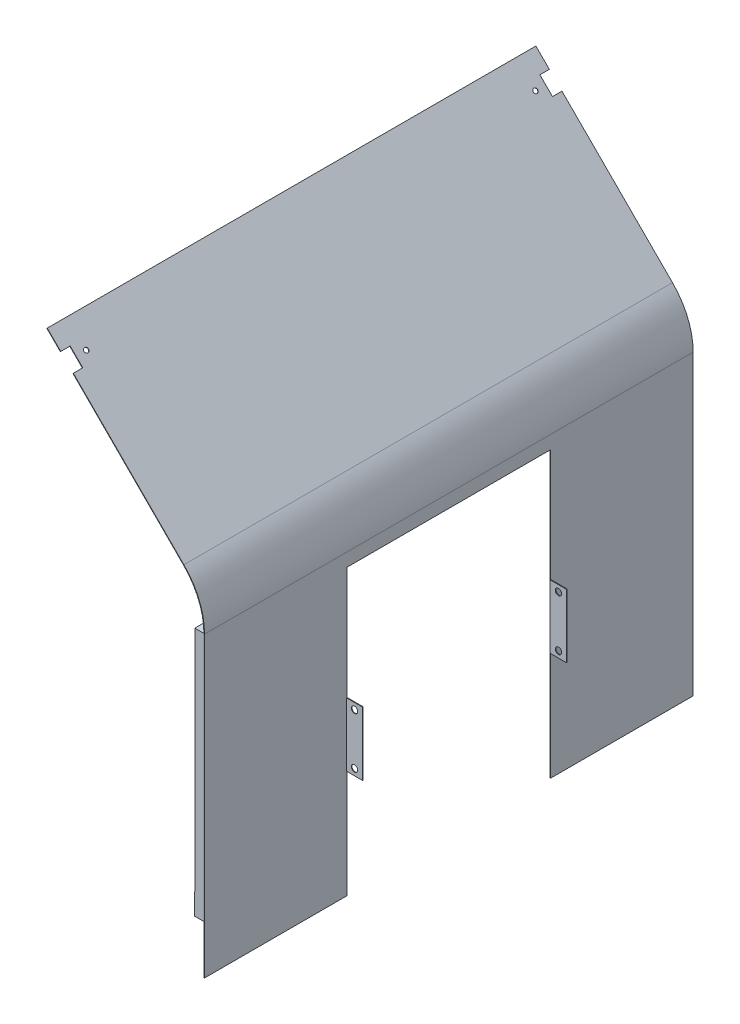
ISO-10303-21;
HEADER;
FILE_DESCRIPTION(('STEP AP214'),'2;1');
FILE_NAME('part.step','',(''),(''),'','','');
FILE_SCHEMA(('AUTOMOTIVE_DESIGN { 1 0 10303 214 1 1 1 1 }'));
ENDSEC;
DATA;
#1=APPLICATION_CONTEXT('core data for automotive mechanical design processes');
#2=APPLICATION_PROTOCOL_DEFINITION('international standard','automotive_design',2000,#1);
#3=PRODUCT_CONTEXT('',#1,'mechanical');
#4=PRODUCT('Part','Part','',(#3));
#5=PRODUCT_RELATED_PRODUCT_CATEGORY('part','',(#4));
#6=PRODUCT_DEFINITION_FORMATION('','',#4);
#7=PRODUCT_DEFINITION_CONTEXT('part definition',#1,'design');
#8=PRODUCT_DEFINITION('design','',#6,#7);
#9=PRODUCT_DEFINITION_SHAPE('','',#8);
#10=(LENGTH_UNIT() NAMED_UNIT(*) SI_UNIT(.MILLI.,.METRE.));
#11=(NAMED_UNIT(*) PLANE_ANGLE_UNIT() SI_UNIT($,.RADIAN.));
#12=(NAMED_UNIT(*) SI_UNIT($,.STERADIAN.) SOLID_ANGLE_UNIT());
#13=UNCERTAINTY_MEASURE_WITH_UNIT(LENGTH_MEASURE(1.E-05),#10,'distance_accuracy_value','');
#14=(GEOMETRIC_REPRESENTATION_CONTEXT(3) GLOBAL_UNCERTAINTY_ASSIGNED_CONTEXT((#13)) GLOBAL_UNIT_ASSIGNED_CONTEXT((#10,
#11,#12)) REPRESENTATION_CONTEXT('',''));
#15=CARTESIAN_POINT('',(0.,0.,0.));
#16=DIRECTION('',(0.,0.,1.));
#17=DIRECTION('',(1.,0.,0.));
#18=AXIS2_PLACEMENT_3D('',#15,#16,#17);
#19=CARTESIAN_POINT('',(1010.,-9.9999999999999,1519.18341252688));
#20=DIRECTION('',(-1.,0.,0.));
#21=DIRECTION('',(0.,-1.,0.));
#22=AXIS2_PLACEMENT_3D('',#19,#20,#21);
#23=PLANE('',#22);
#24=DIRECTION('',(0.,0.,-1.));
#25=VECTOR('',#24,1.);
#26=CARTESIAN_POINT('',(1010.,458.578643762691,1519.18341252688));
#27=LINE('',#26,#25);
#28=CARTESIAN_POINT('',(1010.,458.578643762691,769.));
#29=VERTEX_POINT('',#28);
#30=CARTESIAN_POINT('',(1010.,458.578643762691,768.370476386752));
#31=VERTEX_POINT('',#30);
#32=EDGE_CURVE('E606',#29,#31,#27,.T.);
#33=ORIENTED_EDGE('',*,*,#32,.T.);
#34=DIRECTION('',(0.,0.99999994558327,-0.000329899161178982));
#35=VECTOR('',#34,1.);
#36=CARTESIAN_POINT('',(1010.,458.578643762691,768.370476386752));
#37=LINE('',#36,#35);
#38=CARTESIAN_POINT('',(1010.,65.9628949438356,768.500000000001));
#39=VERTEX_POINT('',#38);
#40=EDGE_CURVE('E48',#39,#31,#37,.T.);
#41=ORIENTED_EDGE('',*,*,#40,.F.);
#42=DIRECTION('',(0.,0.,1.));
#43=VECTOR('',#42,1.);
#44=CARTESIAN_POINT('',(1010.,65.9628949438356,768.500000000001));
#45=LINE('',#44,#43);
#46=CARTESIAN_POINT('',(1010.,65.9628949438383,697.599999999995));
#47=VERTEX_POINT('',#46);
#48=EDGE_CURVE('E43',#47,#39,#45,.T.);
#49=ORIENTED_EDGE('',*,*,#48,.F.);
#50=DIRECTION('',(0.,-1.,0.));
#51=VECTOR('',#50,1.);
#52=CARTESIAN_POINT('',(1010.,458.578643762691,697.599999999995));
#53=LINE('',#52,#51);
#54=CARTESIAN_POINT('',(1010.,458.578643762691,697.599999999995));
#55=VERTEX_POINT('',#54);
#56=EDGE_CURVE('E837',#55,#47,#53,.T.);
#57=ORIENTED_EDGE('',*,*,#56,.F.);
#58=DIRECTION('',(0.,0.,-1.));
#59=VECTOR('',#58,1.);
#60=CARTESIAN_POINT('',(1010.,458.578643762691,698.370476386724));
#61=LINE('',#60,#59);
#62=CARTESIAN_POINT('',(1010.,458.578643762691,1.3986016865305));
#63=VERTEX_POINT('',#62);
#64=EDGE_CURVE('E533',#55,#63,#61,.T.);
#65=ORIENTED_EDGE('',*,*,#64,.T.);
#66=DIRECTION('',(0.,1.,0.));
#67=VECTOR('',#66,1.);
#68=CARTESIAN_POINT('',(1010.,458.57864376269,1.39860168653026));
#69=LINE('',#68,#67);
#70=CARTESIAN_POINT('',(1010.,65.9628949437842,1.39860168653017));
#71=VERTEX_POINT('',#70);
#72=EDGE_CURVE('E309',#63,#71,#69,.F.);
#73=ORIENTED_EDGE('',*,*,#72,.T.);
#74=DIRECTION('',(0.,0.,-1.));
#75=VECTOR('',#74,1.);
#76=CARTESIAN_POINT('',(1010.,65.9628949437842,1.39860168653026));
#77=LINE('',#76,#75);
#78=CARTESIAN_POINT('',(1010.,65.9628949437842,0.498601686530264));
#79=VERTEX_POINT('',#78);
#80=EDGE_CURVE('E301',#71,#79,#77,.T.);
#81=ORIENTED_EDGE('',*,*,#80,.T.);
#82=DIRECTION('',(0.,-1.,0.));
#83=VECTOR('',#82,1.);
#84=CARTESIAN_POINT('',(1010.,458.57864376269,0.498601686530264));
#85=LINE('',#84,#83);
#86=CARTESIAN_POINT('',(1010.,458.578643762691,0.498601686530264));
#87=VERTEX_POINT('',#86);
#88=EDGE_CURVE('E297',#87,#79,#85,.T.);
#89=ORIENTED_EDGE('',*,*,#88,.F.);
#90=CARTESIAN_POINT('',(1010.,458.578643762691,0.));
#91=VERTEX_POINT('',#90);
#92=EDGE_CURVE('E605',#87,#91,#27,.T.);
#93=ORIENTED_EDGE('',*,*,#92,.T.);
#94=DIRECTION('',(0.,1.,0.));
#95=VECTOR('',#94,1.);
#96=CARTESIAN_POINT('',(1010.,-9.9999999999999,0.));
#97=LINE('',#96,#95);
#98=CARTESIAN_POINT('',(1010.,-9.9999999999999,0.));
#99=VERTEX_POINT('',#98);
#100=EDGE_CURVE('E581',#99,#91,#97,.T.);
#101=ORIENTED_EDGE('',*,*,#100,.F.);
#102=DIRECTION('',(0.,0.,-1.));
#103=VECTOR('',#102,1.);
#104=CARTESIAN_POINT('',(1010.,-9.9999999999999,1519.18341252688));
#105=LINE('',#104,#103);
#106=CARTESIAN_POINT('',(1010.,-9.9999999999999,224.5));
#107=VERTEX_POINT('',#106);
#108=EDGE_CURVE('E601',#107,#99,#105,.T.);
#109=ORIENTED_EDGE('',*,*,#108,.F.);
#110=DIRECTION('',(0.,-1.,0.));
#111=VECTOR('',#110,1.);
#112=CARTESIAN_POINT('',(1010.,-9.9999999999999,224.5));
#113=LINE('',#112,#111);
#114=CARTESIAN_POINT('',(1010.,437.74921821,224.5));
#115=VERTEX_POINT('',#114);
#116=EDGE_CURVE('E505',#115,#107,#113,.T.);
#117=ORIENTED_EDGE('',*,*,#116,.F.);
#118=DIRECTION('',(0.,0.,-1.));
#119=VECTOR('',#118,1.);
#120=CARTESIAN_POINT('',(1010.,437.74921821,224.5));
#121=LINE('',#120,#119);
#122=CARTESIAN_POINT('',(1010.,437.74921821,544.5));
#123=VERTEX_POINT('',#122);
#124=EDGE_CURVE('E509',#123,#115,#121,.T.);
#125=ORIENTED_EDGE('',*,*,#124,.F.);
#126=DIRECTION('',(0.,1.,0.));
#127=VECTOR('',#126,1.);
#128=CARTESIAN_POINT('',(1010.,-9.9999999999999,544.5));
#129=LINE('',#128,#127);
#130=CARTESIAN_POINT('',(1010.,-9.9999999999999,544.5));
#131=VERTEX_POINT('',#130);
#132=EDGE_CURVE('E507',#131,#123,#129,.T.);
#133=ORIENTED_EDGE('',*,*,#132,.F.);
#134=CARTESIAN_POINT('',(1010.,-9.9999999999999,768.999999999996));
#135=VERTEX_POINT('',#134);
#136=EDGE_CURVE('E602',#135,#131,#105,.T.);
#137=ORIENTED_EDGE('',*,*,#136,.F.);
#138=DIRECTION('',(0.,-1.,0.));
#139=VECTOR('',#138,1.);
#140=CARTESIAN_POINT('',(1010.,-9.9999999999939,768.999999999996));
#141=LINE('',#140,#139);
#142=EDGE_CURVE('E558',#29,#135,#141,.T.);
#143=ORIENTED_EDGE('',*,*,#142,.F.);
#144=EDGE_LOOP('',(#33,#41,#49,#57,#65,#73,#81,#89,#93,#101,#109,#117,#125,#133,#137,#143));
#145=FACE_BOUND('',#144,.T.);
#146=ADVANCED_FACE('F26',(#145),#23,.T.);
#147=CARTESIAN_POINT('',(994.999999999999,458.578643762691,698.370476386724));
#148=DIRECTION('',(0.,-1.,0.));
#149=DIRECTION('',(0.,0.,-1.));
#150=AXIS2_PLACEMENT_3D('',#147,#148,#149);
#151=PLANE('',#150);
#152=ORIENTED_EDGE('',*,*,#64,.F.);
#153=DIRECTION('',(1.,0.,0.));
#154=VECTOR('',#153,1.);
#155=CARTESIAN_POINT('',(994.999999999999,458.578643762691,697.599999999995));
#156=LINE('',#155,#154);
#157=CARTESIAN_POINT('',(994.999999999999,458.578643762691,697.599999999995));
#158=VERTEX_POINT('',#157);
#159=EDGE_CURVE('E298',#158,#55,#156,.T.);
#160=ORIENTED_EDGE('',*,*,#159,.F.);
#161=DIRECTION('',(0.,0.,-1.));
#162=VECTOR('',#161,1.);
#163=CARTESIAN_POINT('',(994.999999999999,458.578643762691,698.370476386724));
#164=LINE('',#163,#162);
#165=CARTESIAN_POINT('',(994.999999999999,458.578643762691,1.3986016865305));
#166=VERTEX_POINT('',#165);
#167=EDGE_CURVE('E540',#158,#166,#164,.T.);
#168=ORIENTED_EDGE('',*,*,#167,.T.);
#169=DIRECTION('',(1.,0.,0.));
#170=VECTOR('',#169,1.);
#171=CARTESIAN_POINT('',(994.999999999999,458.57864376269,1.39860168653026));
#172=LINE('',#171,#170);
#173=EDGE_CURVE('E317',#166,#63,#172,.T.);
#174=ORIENTED_EDGE('',*,*,#173,.T.);
#175=EDGE_LOOP('',(#152,#160,#168,#174));
#176=FACE_BOUND('',#175,.T.);
#177=ADVANCED_FACE('F708',(#176),#151,.T.);
#178=CARTESIAN_POINT('',(803.759757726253,710.382377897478,1519.18341252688));
#179=DIRECTION('',(-0.707106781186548,0.707106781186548,0.));
#180=DIRECTION('',(-0.707106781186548,-0.707106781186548,0.));
#181=AXIS2_PLACEMENT_3D('',#178,#179,#180);
#182=PLANE('',#181);
#183=DIRECTION('',(0.707106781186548,0.707106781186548,0.));
#184=VECTOR('',#183,1.);
#185=CARTESIAN_POINT('',(804.396153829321,711.018774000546,754.160000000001));
#186=LINE('',#185,#184);
#187=CARTESIAN_POINT('',(803.759757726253,710.382377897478,754.160000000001));
#188=VERTEX_POINT('',#187);
#189=CARTESIAN_POINT('',(804.39615382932,711.018774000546,754.160000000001));
#190=VERTEX_POINT('',#189);
#191=EDGE_CURVE('E378',#188,#190,#186,.T.);
#192=ORIENTED_EDGE('',*,*,#191,.F.);
#193=DIRECTION('',(0.,0.,-1.));
#194=VECTOR('',#193,1.);
#195=CARTESIAN_POINT('',(803.759757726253,710.382377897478,1519.18341252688));
#196=LINE('',#195,#194);
#197=CARTESIAN_POINT('',(803.759757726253,710.382377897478,769.000000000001));
#198=VERTEX_POINT('',#197);
#199=EDGE_CURVE('E614',#198,#188,#196,.T.);
#200=ORIENTED_EDGE('',*,*,#199,.F.);
#201=DIRECTION('',(-0.707106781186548,-0.707106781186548,0.));
#202=VECTOR('',#201,1.);
#203=CARTESIAN_POINT('',(803.759757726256,710.382377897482,769.000000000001));
#204=LINE('',#203,#202);
#205=CARTESIAN_POINT('',(804.39615382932,711.018774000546,769.000000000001));
#206=VERTEX_POINT('',#205);
#207=EDGE_CURVE('E564',#206,#198,#204,.T.);
#208=ORIENTED_EDGE('',*,*,#207,.F.);
#209=DIRECTION('',(0.,0.,-1.));
#210=VECTOR('',#209,1.);
#211=CARTESIAN_POINT('',(804.39615382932,711.018774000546,1519.18341252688));
#212=LINE('',#211,#210);
#213=EDGE_CURVE('E619',#206,#190,#212,.T.);
#214=ORIENTED_EDGE('',*,*,#213,.T.);
#215=EDGE_LOOP('',(#192,#200,#208,#214));
#216=FACE_BOUND('',#215,.T.);
#217=ADVANCED_FACE('F634',(#216),#182,.T.);
#218=CARTESIAN_POINT('',(1010.9,-9.9999999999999,1519.18341252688));
#219=DIRECTION('',(0.,-1.,0.));
#220=DIRECTION('',(1.,0.,0.));
#221=AXIS2_PLACEMENT_3D('',#218,#219,#220);
#222=PLANE('',#221);
#223=DIRECTION('',(-1.,0.,0.));
#224=VECTOR('',#223,1.);
#225=CARTESIAN_POINT('',(1020.,-9.9999999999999,224.5));
#226=LINE('',#225,#224);
#227=CARTESIAN_POINT('',(1010.9,-9.9999999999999,224.5));
#228=VERTEX_POINT('',#227);
#229=EDGE_CURVE('E512',#228,#107,#226,.T.);
#230=ORIENTED_EDGE('',*,*,#229,.T.);
#231=ORIENTED_EDGE('',*,*,#108,.T.);
#232=DIRECTION('',(-1.,0.,0.));
#233=VECTOR('',#232,1.);
#234=CARTESIAN_POINT('',(1010.9,-9.9999999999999,0.));
#235=LINE('',#234,#233);
#236=CARTESIAN_POINT('',(1010.9,-9.9999999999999,0.));
#237=VERTEX_POINT('',#236);
#238=EDGE_CURVE('E584',#237,#99,#235,.T.);
#239=ORIENTED_EDGE('',*,*,#238,.F.);
#240=DIRECTION('',(0.,0.,-1.));
#241=VECTOR('',#240,1.);
#242=CARTESIAN_POINT('',(1010.9,-9.9999999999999,1519.18341252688));
#243=LINE('',#242,#241);
#244=EDGE_CURVE('E597',#228,#237,#243,.T.);
#245=ORIENTED_EDGE('',*,*,#244,.F.);
#246=EDGE_LOOP('',(#230,#231,#239,#245));
#247=FACE_BOUND('',#246,.T.);
#248=ADVANCED_FACE('F730',(#247),#222,.T.);
#249=CARTESIAN_POINT('',(900.,458.578643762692,0.));
#250=DIRECTION('',(0.,0.,1.));
#251=DIRECTION('',(1.,0.,0.));
#252=AXIS2_PLACEMENT_3D('',#249,#250,#251);
#253=PLANE('',#252);
#254=DIRECTION('',(-0.707106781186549,0.707106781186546,0.));
#255=VECTOR('',#254,1.);
#256=CARTESIAN_POINT('',(978.418142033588,536.996785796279,0.));
#257=LINE('',#256,#255);
#258=CARTESIAN_POINT('',(978.418142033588,536.996785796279,0.));
#259=VERTEX_POINT('',#258);
#260=CARTESIAN_POINT('',(804.39615382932,711.018774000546,0.));
#261=VERTEX_POINT('',#260);
#262=EDGE_CURVE('E551',#259,#261,#257,.T.);
#263=ORIENTED_EDGE('',*,*,#262,.F.);
#264=CARTESIAN_POINT('',(900.,458.578643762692,0.));
#265=DIRECTION('',(0.,0.,1.));
#266=DIRECTION('',(1.,0.,0.));
#267=AXIS2_PLACEMENT_3D('',#264,#265,#266);
#268=CIRCLE('',#267,110.9);
#269=CARTESIAN_POINT('',(1010.9,458.578643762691,0.));
#270=VERTEX_POINT('',#269);
#271=EDGE_CURVE('E590',#270,#259,#268,.T.);
#272=ORIENTED_EDGE('',*,*,#271,.F.);
#273=DIRECTION('',(0.,1.,0.));
#274=VECTOR('',#273,1.);
#275=CARTESIAN_POINT('',(1010.9,-9.9999999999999,0.));
#276=LINE('',#275,#274);
#277=EDGE_CURVE('E587',#237,#270,#276,.T.);
#278=ORIENTED_EDGE('',*,*,#277,.F.);
#279=ORIENTED_EDGE('',*,*,#238,.T.);
#280=ORIENTED_EDGE('',*,*,#100,.T.);
#281=CARTESIAN_POINT('',(900.,458.578643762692,0.));
#282=DIRECTION('',(0.,0.,1.));
#283=DIRECTION('',(1.,0.,0.));
#284=AXIS2_PLACEMENT_3D('',#281,#282,#283);
#285=CIRCLE('',#284,110.);
#286=CARTESIAN_POINT('',(977.781745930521,536.360389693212,0.));
#287=VERTEX_POINT('',#286);
#288=EDGE_CURVE('E578',#91,#287,#285,.T.);
#289=ORIENTED_EDGE('',*,*,#288,.T.);
#290=DIRECTION('',(-0.707106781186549,0.707106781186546,0.));
#291=VECTOR('',#290,1.);
#292=CARTESIAN_POINT('',(977.78174593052,536.360389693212,0.));
#293=LINE('',#292,#291);
#294=CARTESIAN_POINT('',(803.759757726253,710.382377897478,0.));
#295=VERTEX_POINT('',#294);
#296=EDGE_CURVE('E575',#287,#295,#293,.T.);
#297=ORIENTED_EDGE('',*,*,#296,.T.);
#298=DIRECTION('',(0.707106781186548,0.707106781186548,0.));
#299=VECTOR('',#298,1.);
#300=CARTESIAN_POINT('',(803.759757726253,710.382377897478,0.));
#301=LINE('',#300,#299);
#302=EDGE_CURVE('E572',#295,#261,#301,.T.);
#303=ORIENTED_EDGE('',*,*,#302,.T.);
#304=EDGE_LOOP('',(#263,#272,#278,#279,#280,#289,#297,#303));
#305=FACE_BOUND('',#304,.T.);
#306=ADVANCED_FACE('F664',(#305),#253,.F.);
#307=CARTESIAN_POINT('',(900.,458.578643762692,1519.18341252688));
#308=DIRECTION('',(0.,0.,-1.));
#309=DIRECTION('',(-1.,0.,0.));
#310=AXIS2_PLACEMENT_3D('',#307,#308,#309);
#311=CYLINDRICAL_SURFACE('',#310,110.9);
#312=DIRECTION('',(0.,0.,-1.));
#313=VECTOR('',#312,1.);
#314=CARTESIAN_POINT('',(978.418142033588,536.996785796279,1519.18341252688));
#315=LINE('',#314,#313);
#316=CARTESIAN_POINT('',(978.418142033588,536.996785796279,769.));
#317=VERTEX_POINT('',#316);
#318=EDGE_CURVE('E593',#317,#259,#315,.T.);
#319=ORIENTED_EDGE('',*,*,#318,.F.);
#320=CARTESIAN_POINT('',(900.,458.578643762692,768.999999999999));
#321=DIRECTION('',(0.,0.,-1.));
#322=DIRECTION('',(0.,1.,0.));
#323=AXIS2_PLACEMENT_3D('',#320,#321,#322);
#324=CIRCLE('',#323,110.9);
#325=CARTESIAN_POINT('',(1010.9,458.578643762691,769.));
#326=VERTEX_POINT('',#325);
#327=EDGE_CURVE('E556',#317,#326,#324,.T.);
#328=ORIENTED_EDGE('',*,*,#327,.T.);
#329=DIRECTION('',(0.,0.,-1.));
#330=VECTOR('',#329,1.);
#331=CARTESIAN_POINT('',(1010.9,458.578643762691,1519.18341252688));
#332=LINE('',#331,#330);
#333=EDGE_CURVE('E595',#326,#270,#332,.T.);
#334=ORIENTED_EDGE('',*,*,#333,.T.);
#335=ORIENTED_EDGE('',*,*,#271,.T.);
#336=EDGE_LOOP('',(#319,#328,#334,#335));
#337=FACE_BOUND('',#336,.T.);
#338=ADVANCED_FACE('F626',(#337),#311,.T.);
#339=CARTESIAN_POINT('',(1010.9,-9.9999999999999,1519.18341252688));
#340=DIRECTION('',(-1.,0.,0.));
#341=DIRECTION('',(0.,-1.,0.));
#342=AXIS2_PLACEMENT_3D('',#339,#340,#341);
#343=PLANE('',#342);
#344=DIRECTION('',(0.,1.,0.));
#345=VECTOR('',#344,1.);
#346=CARTESIAN_POINT('',(1010.9,-9.9999999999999,545.5));
#347=LINE('',#346,#345);
#348=CARTESIAN_POINT('',(1010.9,160.04,545.5));
#349=VERTEX_POINT('',#348);
#350=CARTESIAN_POINT('',(1010.9,260.04,545.5));
#351=VERTEX_POINT('',#350);
#352=EDGE_CURVE('E471',#349,#351,#347,.T.);
#353=ORIENTED_EDGE('',*,*,#352,.T.);
#354=DIRECTION('',(0.,0.,-1.));
#355=VECTOR('',#354,1.);
#356=CARTESIAN_POINT('',(1010.9,260.040000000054,1519.18341252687));
#357=LINE('',#356,#355);
#358=CARTESIAN_POINT('',(1010.9,260.04,544.5));
#359=VERTEX_POINT('',#358);
#360=EDGE_CURVE('E468',#351,#359,#357,.T.);
#361=ORIENTED_EDGE('',*,*,#360,.T.);
#362=DIRECTION('',(0.,1.,0.));
#363=VECTOR('',#362,1.);
#364=CARTESIAN_POINT('',(1010.9,-10.0000000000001,544.5));
#365=LINE('',#364,#363);
#366=CARTESIAN_POINT('',(1010.9,437.74921821,544.5));
#367=VERTEX_POINT('',#366);
#368=EDGE_CURVE('E515',#359,#367,#365,.T.);
#369=ORIENTED_EDGE('',*,*,#368,.T.);
#370=DIRECTION('',(0.,0.,-1.));
#371=VECTOR('',#370,1.);
#372=CARTESIAN_POINT('',(1010.9,437.74921821,1519.18341252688));
#373=LINE('',#372,#371);
#374=CARTESIAN_POINT('',(1010.9,437.74921821,224.5));
#375=VERTEX_POINT('',#374);
#376=EDGE_CURVE('E526',#367,#375,#373,.T.);
#377=ORIENTED_EDGE('',*,*,#376,.T.);
#378=DIRECTION('',(0.,-1.,0.));
#379=VECTOR('',#378,1.);
#380=CARTESIAN_POINT('',(1010.9,-9.99999999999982,224.5));
#381=LINE('',#380,#379);
#382=CARTESIAN_POINT('',(1010.9,260.04,224.5));
#383=VERTEX_POINT('',#382);
#384=EDGE_CURVE('E530',#375,#383,#381,.T.);
#385=ORIENTED_EDGE('',*,*,#384,.T.);
#386=DIRECTION('',(0.,0.,-1.));
#387=VECTOR('',#386,1.);
#388=CARTESIAN_POINT('',(1010.9,260.039999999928,1519.1834125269));
#389=LINE('',#388,#387);
#390=CARTESIAN_POINT('',(1010.9,260.04,223.5));
#391=VERTEX_POINT('',#390);
#392=EDGE_CURVE('E489',#383,#391,#389,.T.);
#393=ORIENTED_EDGE('',*,*,#392,.T.);
#394=DIRECTION('',(0.,-1.,0.));
#395=VECTOR('',#394,1.);
#396=CARTESIAN_POINT('',(1010.9,-9.9999999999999,223.5));
#397=LINE('',#396,#395);
#398=CARTESIAN_POINT('',(1010.9,160.04,223.5));
#399=VERTEX_POINT('',#398);
#400=EDGE_CURVE('E502',#391,#399,#397,.T.);
#401=ORIENTED_EDGE('',*,*,#400,.T.);
#402=DIRECTION('',(0.,0.,1.));
#403=VECTOR('',#402,1.);
#404=CARTESIAN_POINT('',(1010.9,160.04,1519.18341252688));
#405=LINE('',#404,#403);
#406=CARTESIAN_POINT('',(1010.9,160.04,224.5));
#407=VERTEX_POINT('',#406);
#408=EDGE_CURVE('E499',#399,#407,#405,.T.);
#409=ORIENTED_EDGE('',*,*,#408,.T.);
#410=EDGE_CURVE('E529',#407,#228,#381,.T.);
#411=ORIENTED_EDGE('',*,*,#410,.T.);
#412=ORIENTED_EDGE('',*,*,#244,.T.);
#413=ORIENTED_EDGE('',*,*,#277,.T.);
#414=ORIENTED_EDGE('',*,*,#333,.F.);
#415=DIRECTION('',(0.,-1.,0.));
#416=VECTOR('',#415,1.);
#417=CARTESIAN_POINT('',(1010.9,-9.9999999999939,768.999999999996));
#418=LINE('',#417,#416);
#419=CARTESIAN_POINT('',(1010.9,-9.9999999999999,768.999999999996));
#420=VERTEX_POINT('',#419);
#421=EDGE_CURVE('E552',#326,#420,#418,.T.);
#422=ORIENTED_EDGE('',*,*,#421,.T.);
#423=CARTESIAN_POINT('',(1010.9,-9.9999999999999,544.5));
#424=VERTEX_POINT('',#423);
#425=EDGE_CURVE('E598',#420,#424,#243,.T.);
#426=ORIENTED_EDGE('',*,*,#425,.T.);
#427=CARTESIAN_POINT('',(1010.9,160.04,544.5));
#428=VERTEX_POINT('',#427);
#429=EDGE_CURVE('E523',#424,#428,#365,.T.);
#430=ORIENTED_EDGE('',*,*,#429,.T.);
#431=DIRECTION('',(0.,0.,1.));
#432=VECTOR('',#431,1.);
#433=CARTESIAN_POINT('',(1010.9,160.04,1519.18341252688));
#434=LINE('',#433,#432);
#435=EDGE_CURVE('E458',#428,#349,#434,.T.);
#436=ORIENTED_EDGE('',*,*,#435,.T.);
#437=EDGE_LOOP('',(#353,#361,#369,#377,#385,#393,#401,#409,#411,#412,#413,#414,#422,#426,#430,#436));
#438=FACE_BOUND('',#437,.T.);
#439=ADVANCED_FACE('F657',(#438),#343,.F.);
#440=DIRECTION('',(-1.,0.,0.));
#441=VECTOR('',#440,1.);
#442=CARTESIAN_POINT('',(1020.,-9.9999999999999,544.5));
#443=LINE('',#442,#441);
#444=EDGE_CURVE('E519',#424,#131,#443,.T.);
#445=ORIENTED_EDGE('',*,*,#444,.F.);
#446=ORIENTED_EDGE('',*,*,#425,.F.);
#447=DIRECTION('',(1.,0.,0.));
#448=VECTOR('',#447,1.);
#449=CARTESIAN_POINT('',(1010.9,-9.9999999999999,768.999999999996));
#450=LINE('',#449,#448);
#451=EDGE_CURVE('E555',#135,#420,#450,.T.);
#452=ORIENTED_EDGE('',*,*,#451,.F.);
#453=ORIENTED_EDGE('',*,*,#136,.T.);
#454=EDGE_LOOP('',(#445,#446,#452,#453));
#455=FACE_BOUND('',#454,.T.);
#456=ADVANCED_FACE('F655',(#455),#222,.T.);
#457=CARTESIAN_POINT('',(900.,458.578643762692,1519.18341252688));
#458=DIRECTION('',(0.,0.,-1.));
#459=DIRECTION('',(-1.,0.,0.));
#460=AXIS2_PLACEMENT_3D('',#457,#458,#459);
#461=CYLINDRICAL_SURFACE('',#460,110.);
#462=CARTESIAN_POINT('',(900.,458.578643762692,0.498601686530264));
#463=DIRECTION('',(0.,0.,-1.));
#464=DIRECTION('',(-1.,0.,0.));
#465=AXIS2_PLACEMENT_3D('',#462,#463,#464);
#466=CIRCLE('',#465,110.);
#467=CARTESIAN_POINT('',(1009.9963181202,459.478643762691,0.498601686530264));
#468=VERTEX_POINT('',#467);
#469=EDGE_CURVE('E11',#468,#87,#466,.T.);
#470=ORIENTED_EDGE('',*,*,#469,.F.);
#471=DIRECTION('',(0.,0.,-1.));
#472=VECTOR('',#471,1.);
#473=CARTESIAN_POINT('',(1009.9963181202,459.478643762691,1519.18341252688));
#474=LINE('',#473,#472);
#475=CARTESIAN_POINT('',(1009.9963181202,459.478643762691,698.370476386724));
#476=VERTEX_POINT('',#475);
#477=EDGE_CURVE('E35',#468,#476,#474,.F.);
#478=ORIENTED_EDGE('',*,*,#477,.T.);
#479=CARTESIAN_POINT('',(900.,458.578643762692,698.370476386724));
#480=DIRECTION('',(0.,0.,1.));
#481=DIRECTION('',(1.,0.,0.));
#482=AXIS2_PLACEMENT_3D('',#479,#480,#481);
#483=CIRCLE('',#482,110.);
#484=CARTESIAN_POINT('',(1010.,458.578643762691,698.370476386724));
#485=VERTEX_POINT('',#484);
#486=EDGE_CURVE('E569',#485,#476,#483,.T.);
#487=ORIENTED_EDGE('',*,*,#486,.F.);
#488=DIRECTION('',(0.,0.,-1.));
#489=VECTOR('',#488,1.);
#490=CARTESIAN_POINT('',(1010.,458.578643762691,697.599999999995));
#491=LINE('',#490,#489);
#492=EDGE_CURVE('E648',#31,#485,#491,.T.);
#493=ORIENTED_EDGE('',*,*,#492,.F.);
#494=ORIENTED_EDGE('',*,*,#32,.F.);
#495=CARTESIAN_POINT('',(900.,458.578643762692,768.999999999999));
#496=DIRECTION('',(0.,0.,-1.));
#497=DIRECTION('',(0.,1.,0.));
#498=AXIS2_PLACEMENT_3D('',#495,#496,#497);
#499=CIRCLE('',#498,110.);
#500=CARTESIAN_POINT('',(977.781745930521,536.360389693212,769.));
#501=VERTEX_POINT('',#500);
#502=EDGE_CURVE('E560',#501,#29,#499,.T.);
#503=ORIENTED_EDGE('',*,*,#502,.F.);
#504=DIRECTION('',(0.,0.,-1.));
#505=VECTOR('',#504,1.);
#506=CARTESIAN_POINT('',(977.781745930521,536.360389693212,1519.18341252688));
#507=LINE('',#506,#505);
#508=EDGE_CURVE('E608',#501,#287,#507,.T.);
#509=ORIENTED_EDGE('',*,*,#508,.T.);
#510=ORIENTED_EDGE('',*,*,#288,.F.);
#511=ORIENTED_EDGE('',*,*,#92,.F.);
#512=EDGE_LOOP('',(#470,#478,#487,#493,#494,#503,#509,#510,#511));
#513=FACE_BOUND('',#512,.T.);
#514=ADVANCED_FACE('F645',(#513),#461,.F.);
#515=CARTESIAN_POINT('',(977.78174593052,536.360389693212,1519.18341252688));
#516=DIRECTION('',(-0.707106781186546,-0.707106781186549,0.));
#517=DIRECTION('',(0.707106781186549,-0.707106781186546,0.));
#518=AXIS2_PLACEMENT_3D('',#515,#516,#517);
#519=PLANE('',#518);
#520=CARTESIAN_POINT('',(793.153156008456,720.988979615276,30.9999999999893));
#521=DIRECTION('',(-0.707106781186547,-0.707106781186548,0.));
#522=DIRECTION('',(0.707106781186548,-0.707106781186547,0.));
#523=AXIS2_PLACEMENT_3D('',#520,#521,#522);
#524=CIRCLE('',#523,3.5);
#525=CARTESIAN_POINT('',(795.628029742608,718.514105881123,30.9999999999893));
#526=VERTEX_POINT('',#525);
#527=EDGE_CURVE('E326',#526,#526,#524,.T.);
#528=ORIENTED_EDGE('',*,*,#527,.F.);
#529=EDGE_LOOP('',(#528));
#530=FACE_BOUND('',#529,.T.);
#531=CARTESIAN_POINT('',(793.153156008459,720.988979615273,738.000000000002));
#532=DIRECTION('',(-0.707106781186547,-0.707106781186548,0.));
#533=DIRECTION('',(0.707106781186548,-0.707106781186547,0.));
#534=AXIS2_PLACEMENT_3D('',#531,#532,#533);
#535=CIRCLE('',#534,3.5);
#536=CARTESIAN_POINT('',(795.628029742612,718.51410588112,738.000000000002));
#537=VERTEX_POINT('',#536);
#538=EDGE_CURVE('E329',#537,#537,#535,.T.);
#539=ORIENTED_EDGE('',*,*,#538,.F.);
#540=EDGE_LOOP('',(#539));
#541=FACE_BOUND('',#540,.T.);
#542=DIRECTION('',(0.707106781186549,-0.707106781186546,0.));
#543=VECTOR('',#542,1.);
#544=CARTESIAN_POINT('',(977.781745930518,536.360389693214,769.));
#545=LINE('',#544,#543);
#546=EDGE_CURVE('E562',#198,#501,#545,.T.);
#547=ORIENTED_EDGE('',*,*,#546,.F.);
#548=ORIENTED_EDGE('',*,*,#199,.T.);
#549=DIRECTION('',(0.707106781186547,-0.707106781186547,0.));
#550=VECTOR('',#549,1.);
#551=CARTESIAN_POINT('',(783.960767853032,730.181367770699,754.160000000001));
#552=LINE('',#551,#550);
#553=CARTESIAN_POINT('',(783.960767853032,730.181367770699,754.160000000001));
#554=VERTEX_POINT('',#553);
#555=EDGE_CURVE('E406',#554,#188,#552,.T.);
#556=ORIENTED_EDGE('',*,*,#555,.F.);
#557=DIRECTION('',(0.,0.,1.));
#558=VECTOR('',#557,1.);
#559=CARTESIAN_POINT('',(783.960767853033,730.181367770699,0.));
#560=LINE('',#559,#558);
#561=CARTESIAN_POINT('',(783.960767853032,730.181367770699,769.000000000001));
#562=VERTEX_POINT('',#561);
#563=EDGE_CURVE('E348',#554,#562,#560,.T.);
#564=ORIENTED_EDGE('',*,*,#563,.T.);
#565=DIRECTION('',(0.707106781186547,-0.707106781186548,0.));
#566=VECTOR('',#565,1.);
#567=CARTESIAN_POINT('',(762.747564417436,751.394571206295,769.000000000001));
#568=LINE('',#567,#566);
#569=CARTESIAN_POINT('',(762.747564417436,751.394571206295,769.000000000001));
#570=VERTEX_POINT('',#569);
#571=EDGE_CURVE('E364',#570,#562,#568,.T.);
#572=ORIENTED_EDGE('',*,*,#571,.F.);
#573=DIRECTION('',(0.,0.,1.));
#574=VECTOR('',#573,1.);
#575=CARTESIAN_POINT('',(762.747564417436,751.394571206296,0.));
#576=LINE('',#575,#574);
#577=CARTESIAN_POINT('',(762.747564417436,751.394571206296,0.));
#578=VERTEX_POINT('',#577);
#579=EDGE_CURVE('E362',#578,#570,#576,.T.);
#580=ORIENTED_EDGE('',*,*,#579,.F.);
#581=DIRECTION('',(0.707106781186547,-0.707106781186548,0.));
#582=VECTOR('',#581,1.);
#583=CARTESIAN_POINT('',(762.747564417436,751.394571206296,0.));
#584=LINE('',#583,#582);
#585=CARTESIAN_POINT('',(783.960767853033,730.181367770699,0.));
#586=VERTEX_POINT('',#585);
#587=EDGE_CURVE('E367',#578,#586,#584,.T.);
#588=ORIENTED_EDGE('',*,*,#587,.T.);
#589=CARTESIAN_POINT('',(783.960767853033,730.181367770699,14.849610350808));
#590=VERTEX_POINT('',#589);
#591=EDGE_CURVE('E350',#586,#590,#560,.T.);
#592=ORIENTED_EDGE('',*,*,#591,.T.);
#593=DIRECTION('',(0.707106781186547,-0.707106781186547,0.));
#594=VECTOR('',#593,1.);
#595=CARTESIAN_POINT('',(783.960767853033,730.181367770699,14.849610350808));
#596=LINE('',#595,#594);
#597=CARTESIAN_POINT('',(803.759757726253,710.382377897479,14.849610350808));
#598=VERTEX_POINT('',#597);
#599=EDGE_CURVE('E391',#590,#598,#596,.T.);
#600=ORIENTED_EDGE('',*,*,#599,.T.);
#601=EDGE_CURVE('E388',#598,#295,#196,.T.);
#602=ORIENTED_EDGE('',*,*,#601,.T.);
#603=ORIENTED_EDGE('',*,*,#296,.F.);
#604=ORIENTED_EDGE('',*,*,#508,.F.);
#605=EDGE_LOOP('',(#547,#548,#556,#564,#572,#580,#588,#592,#600,#602,#603,#604));
#606=FACE_BOUND('',#605,.T.);
#607=ADVANCED_FACE('F641',(#530,#541,#606),#519,.T.);
#608=DIRECTION('',(-0.707106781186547,-0.707106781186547,0.));
#609=VECTOR('',#608,1.);
#610=CARTESIAN_POINT('',(804.39615382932,711.018774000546,14.849610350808));
#611=LINE('',#610,#609);
#612=CARTESIAN_POINT('',(804.39615382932,711.018774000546,14.849610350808));
#613=VERTEX_POINT('',#612);
#614=EDGE_CURVE('E374',#613,#598,#611,.T.);
#615=ORIENTED_EDGE('',*,*,#614,.F.);
#616=EDGE_CURVE('E617',#613,#261,#212,.T.);
#617=ORIENTED_EDGE('',*,*,#616,.T.);
#618=ORIENTED_EDGE('',*,*,#302,.F.);
#619=ORIENTED_EDGE('',*,*,#601,.F.);
#620=EDGE_LOOP('',(#615,#617,#618,#619));
#621=FACE_BOUND('',#620,.T.);
#622=ADVANCED_FACE('F722',(#621),#182,.T.);
#623=CARTESIAN_POINT('',(978.418142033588,536.996785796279,1519.18341252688));
#624=DIRECTION('',(-0.707106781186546,-0.707106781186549,0.));
#625=DIRECTION('',(0.707106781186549,-0.707106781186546,0.));
#626=AXIS2_PLACEMENT_3D('',#623,#624,#625);
#627=PLANE('',#626);
#628=CARTESIAN_POINT('',(793.789552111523,721.625375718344,30.9999999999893));
#629=DIRECTION('',(-0.707106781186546,-0.707106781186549,0.));
#630=DIRECTION('',(0.707106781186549,-0.707106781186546,0.));
#631=AXIS2_PLACEMENT_3D('',#628,#629,#630);
#632=CIRCLE('',#631,3.5);
#633=CARTESIAN_POINT('',(796.264425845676,719.150501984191,30.9999999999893));
#634=VERTEX_POINT('',#633);
#635=EDGE_CURVE('E30',#634,#634,#632,.T.);
#636=ORIENTED_EDGE('',*,*,#635,.T.);
#637=EDGE_LOOP('',(#636));
#638=FACE_BOUND('',#637,.T.);
#639=CARTESIAN_POINT('',(793.789552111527,721.62537571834,738.000000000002));
#640=DIRECTION('',(-0.707106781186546,-0.707106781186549,0.));
#641=DIRECTION('',(0.707106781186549,-0.707106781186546,0.));
#642=AXIS2_PLACEMENT_3D('',#639,#640,#641);
#643=CIRCLE('',#642,3.5);
#644=CARTESIAN_POINT('',(796.264425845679,719.150501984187,738.000000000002));
#645=VERTEX_POINT('',#644);
#646=EDGE_CURVE('E332',#645,#645,#643,.T.);
#647=ORIENTED_EDGE('',*,*,#646,.T.);
#648=EDGE_LOOP('',(#647));
#649=FACE_BOUND('',#648,.T.);
#650=ORIENTED_EDGE('',*,*,#213,.F.);
#651=DIRECTION('',(0.707106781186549,-0.707106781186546,0.));
#652=VECTOR('',#651,1.);
#653=CARTESIAN_POINT('',(978.418142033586,536.996785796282,769.));
#654=LINE('',#653,#652);
#655=EDGE_CURVE('E566',#206,#317,#654,.T.);
#656=ORIENTED_EDGE('',*,*,#655,.T.);
#657=ORIENTED_EDGE('',*,*,#318,.T.);
#658=ORIENTED_EDGE('',*,*,#262,.T.);
#659=ORIENTED_EDGE('',*,*,#616,.F.);
#660=DIRECTION('',(0.707106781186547,-0.707106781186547,0.));
#661=VECTOR('',#660,1.);
#662=CARTESIAN_POINT('',(784.597163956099,730.817763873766,14.849610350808));
#663=LINE('',#662,#661);
#664=CARTESIAN_POINT('',(784.597163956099,730.817763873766,14.849610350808));
#665=VERTEX_POINT('',#664);
#666=EDGE_CURVE('E422',#665,#613,#663,.T.);
#667=ORIENTED_EDGE('',*,*,#666,.F.);
#668=DIRECTION('',(0.,0.,-1.));
#669=VECTOR('',#668,1.);
#670=CARTESIAN_POINT('',(784.5971639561,730.817763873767,769.000000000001));
#671=LINE('',#670,#669);
#672=CARTESIAN_POINT('',(784.597163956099,730.817763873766,0.));
#673=VERTEX_POINT('',#672);
#674=EDGE_CURVE('E336',#665,#673,#671,.T.);
#675=ORIENTED_EDGE('',*,*,#674,.T.);
#676=DIRECTION('',(0.707106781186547,-0.707106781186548,0.));
#677=VECTOR('',#676,1.);
#678=CARTESIAN_POINT('',(763.383960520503,752.030967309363,0.));
#679=LINE('',#678,#677);
#680=CARTESIAN_POINT('',(763.383960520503,752.030967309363,0.));
#681=VERTEX_POINT('',#680);
#682=EDGE_CURVE('E370',#681,#673,#679,.T.);
#683=ORIENTED_EDGE('',*,*,#682,.F.);
#684=DIRECTION('',(0.,0.,-1.));
#685=VECTOR('',#684,1.);
#686=CARTESIAN_POINT('',(763.383960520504,752.030967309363,769.000000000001));
#687=LINE('',#686,#685);
#688=CARTESIAN_POINT('',(763.383960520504,752.030967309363,769.000000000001));
#689=VERTEX_POINT('',#688);
#690=EDGE_CURVE('E358',#689,#681,#687,.T.);
#691=ORIENTED_EDGE('',*,*,#690,.F.);
#692=DIRECTION('',(0.707106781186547,-0.707106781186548,0.));
#693=VECTOR('',#692,1.);
#694=CARTESIAN_POINT('',(763.383960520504,752.030967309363,769.000000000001));
#695=LINE('',#694,#693);
#696=CARTESIAN_POINT('',(784.5971639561,730.817763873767,769.000000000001));
#697=VERTEX_POINT('',#696);
#698=EDGE_CURVE('E372',#689,#697,#695,.T.);
#699=ORIENTED_EDGE('',*,*,#698,.T.);
#700=CARTESIAN_POINT('',(784.5971639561,730.817763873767,754.160000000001));
#701=VERTEX_POINT('',#700);
#702=EDGE_CURVE('E345',#697,#701,#671,.T.);
#703=ORIENTED_EDGE('',*,*,#702,.T.);
#704=DIRECTION('',(0.707106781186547,-0.707106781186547,0.));
#705=VECTOR('',#704,1.);
#706=CARTESIAN_POINT('',(784.5971639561,730.817763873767,754.160000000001));
#707=LINE('',#706,#705);
#708=EDGE_CURVE('E403',#701,#190,#707,.T.);
#709=ORIENTED_EDGE('',*,*,#708,.T.);
#710=EDGE_LOOP('',(#650,#656,#657,#658,#659,#667,#675,#683,#691,#699,#703,#709));
#711=FACE_BOUND('',#710,.T.);
#712=ADVANCED_FACE('F28',(#638,#649,#711),#627,.F.);
#713=CARTESIAN_POINT('',(1056.56854249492,9.99999999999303,768.999999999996));
#714=DIRECTION('',(0.,0.,-1.));
#715=DIRECTION('',(0.999999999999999,0.,0.));
#716=AXIS2_PLACEMENT_3D('',#713,#714,#715);
#717=PLANE('',#716);
#718=ORIENTED_EDGE('',*,*,#207,.T.);
#719=ORIENTED_EDGE('',*,*,#546,.T.);
#720=ORIENTED_EDGE('',*,*,#502,.T.);
#721=ORIENTED_EDGE('',*,*,#142,.T.);
#722=ORIENTED_EDGE('',*,*,#451,.T.);
#723=ORIENTED_EDGE('',*,*,#421,.F.);
#724=ORIENTED_EDGE('',*,*,#327,.F.);
#725=ORIENTED_EDGE('',*,*,#655,.F.);
#726=EDGE_LOOP('',(#718,#719,#720,#721,#722,#723,#724,#725));
#727=FACE_BOUND('',#726,.T.);
#728=ADVANCED_FACE('F629',(#727),#717,.F.);
#729=CARTESIAN_POINT('',(994.999999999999,459.478643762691,698.370476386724));
#730=DIRECTION('',(0.,-1.,0.));
#731=DIRECTION('',(0.,0.,-1.));
#732=AXIS2_PLACEMENT_3D('',#729,#730,#731);
#733=PLANE('',#732);
#734=ORIENTED_EDGE('',*,*,#477,.F.);
#735=DIRECTION('',(1.,0.,0.));
#736=VECTOR('',#735,1.);
#737=CARTESIAN_POINT('',(994.999999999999,459.478643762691,0.498601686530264));
#738=LINE('',#737,#736);
#739=CARTESIAN_POINT('',(994.999999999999,459.478643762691,0.498601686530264));
#740=VERTEX_POINT('',#739);
#741=EDGE_CURVE('E548',#740,#468,#738,.T.);
#742=ORIENTED_EDGE('',*,*,#741,.F.);
#743=DIRECTION('',(0.,0.,1.));
#744=VECTOR('',#743,1.);
#745=CARTESIAN_POINT('',(994.999999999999,459.478643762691,698.370476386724));
#746=LINE('',#745,#744);
#747=CARTESIAN_POINT('',(994.999999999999,459.478643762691,698.370476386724));
#748=VERTEX_POINT('',#747);
#749=EDGE_CURVE('E535',#748,#740,#746,.F.);
#750=ORIENTED_EDGE('',*,*,#749,.F.);
#751=DIRECTION('',(1.,0.,0.));
#752=VECTOR('',#751,1.);
#753=CARTESIAN_POINT('',(994.999999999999,459.478643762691,698.370476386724));
#754=LINE('',#753,#752);
#755=EDGE_CURVE('E544',#748,#476,#754,.T.);
#756=ORIENTED_EDGE('',*,*,#755,.T.);
#757=EDGE_LOOP('',(#734,#742,#750,#756));
#758=FACE_BOUND('',#757,.T.);
#759=ADVANCED_FACE('F754',(#758),#733,.F.);
#760=CARTESIAN_POINT('',(994.999999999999,458.578643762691,0.498601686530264));
#761=DIRECTION('',(0.,0.,-1.));
#762=DIRECTION('',(-1.,0.,0.));
#763=AXIS2_PLACEMENT_3D('',#760,#761,#762);
#764=PLANE('',#763);
#765=ORIENTED_EDGE('',*,*,#741,.T.);
#766=ORIENTED_EDGE('',*,*,#469,.T.);
#767=ORIENTED_EDGE('',*,*,#88,.T.);
#768=DIRECTION('',(1.,0.,0.));
#769=VECTOR('',#768,1.);
#770=CARTESIAN_POINT('',(994.999999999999,65.9628949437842,0.498601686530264));
#771=LINE('',#770,#769);
#772=CARTESIAN_POINT('',(994.999999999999,65.9628949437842,0.498601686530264));
#773=VERTEX_POINT('',#772);
#774=EDGE_CURVE('E323',#773,#79,#771,.T.);
#775=ORIENTED_EDGE('',*,*,#774,.F.);
#776=DIRECTION('',(0.,1.,0.));
#777=VECTOR('',#776,1.);
#778=CARTESIAN_POINT('',(994.999999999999,458.578643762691,0.498601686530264));
#779=LINE('',#778,#777);
#780=EDGE_CURVE('E537',#773,#740,#779,.T.);
#781=ORIENTED_EDGE('',*,*,#780,.T.);
#782=EDGE_LOOP('',(#765,#766,#767,#775,#781));
#783=FACE_BOUND('',#782,.T.);
#784=ADVANCED_FACE('F756',(#783),#764,.T.);
#785=CARTESIAN_POINT('',(994.999999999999,459.478643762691,698.370476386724));
#786=DIRECTION('',(0.,0.,1.));
#787=DIRECTION('',(1.,0.,0.));
#788=AXIS2_PLACEMENT_3D('',#785,#786,#787);
#789=PLANE('',#788);
#790=DIRECTION('',(1.,0.,0.));
#791=VECTOR('',#790,1.);
#792=CARTESIAN_POINT('',(994.999999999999,458.578643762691,698.370476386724));
#793=LINE('',#792,#791);
#794=CARTESIAN_POINT('',(994.999999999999,458.578643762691,698.370476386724));
#795=VERTEX_POINT('',#794);
#796=EDGE_CURVE('E282',#795,#485,#793,.T.);
#797=ORIENTED_EDGE('',*,*,#796,.T.);
#798=ORIENTED_EDGE('',*,*,#486,.T.);
#799=ORIENTED_EDGE('',*,*,#755,.F.);
#800=DIRECTION('',(0.,-1.,0.));
#801=VECTOR('',#800,1.);
#802=CARTESIAN_POINT('',(994.999999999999,459.478643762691,698.370476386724));
#803=LINE('',#802,#801);
#804=EDGE_CURVE('E542',#748,#795,#803,.T.);
#805=ORIENTED_EDGE('',*,*,#804,.T.);
#806=EDGE_LOOP('',(#797,#798,#799,#805));
#807=FACE_BOUND('',#806,.T.);
#808=ADVANCED_FACE('F759',(#807),#789,.T.);
#809=CARTESIAN_POINT('',(994.999999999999,459.478643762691,0.498601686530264));
#810=DIRECTION('',(-1.,0.,0.));
#811=DIRECTION('',(0.,0.,1.));
#812=AXIS2_PLACEMENT_3D('',#809,#810,#811);
#813=PLANE('',#812);
#814=ORIENTED_EDGE('',*,*,#749,.T.);
#815=ORIENTED_EDGE('',*,*,#780,.F.);
#816=DIRECTION('',(0.,0.,-1.));
#817=VECTOR('',#816,1.);
#818=CARTESIAN_POINT('',(994.999999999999,65.9628949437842,1.39860168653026));
#819=LINE('',#818,#817);
#820=CARTESIAN_POINT('',(994.999999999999,65.9628949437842,1.39860168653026));
#821=VERTEX_POINT('',#820);
#822=EDGE_CURVE('E311',#821,#773,#819,.T.);
#823=ORIENTED_EDGE('',*,*,#822,.F.);
#824=DIRECTION('',(0.,1.,0.));
#825=VECTOR('',#824,1.);
#826=CARTESIAN_POINT('',(994.999999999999,458.57864376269,1.39860168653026));
#827=LINE('',#826,#825);
#828=EDGE_CURVE('E314',#166,#821,#827,.F.);
#829=ORIENTED_EDGE('',*,*,#828,.F.);
#830=ORIENTED_EDGE('',*,*,#167,.F.);
#831=DIRECTION('',(0.,-1.,0.));
#832=VECTOR('',#831,1.);
#833=CARTESIAN_POINT('',(994.999999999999,458.578643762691,697.599999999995));
#834=LINE('',#833,#832);
#835=CARTESIAN_POINT('',(994.999999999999,65.9628949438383,697.599999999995));
#836=VERTEX_POINT('',#835);
#837=EDGE_CURVE('E285',#158,#836,#834,.T.);
#838=ORIENTED_EDGE('',*,*,#837,.T.);
#839=DIRECTION('',(0.,0.,1.));
#840=VECTOR('',#839,1.);
#841=CARTESIAN_POINT('',(994.999999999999,65.9628949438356,768.500000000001));
#842=LINE('',#841,#840);
#843=CARTESIAN_POINT('',(994.999999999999,65.9628949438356,768.500000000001));
#844=VERTEX_POINT('',#843);
#845=EDGE_CURVE('E291',#836,#844,#842,.T.);
#846=ORIENTED_EDGE('',*,*,#845,.T.);
#847=DIRECTION('',(0.,0.99999994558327,-0.000329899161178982));
#848=VECTOR('',#847,1.);
#849=CARTESIAN_POINT('',(994.999999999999,458.578643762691,768.370476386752));
#850=LINE('',#849,#848);
#851=CARTESIAN_POINT('',(994.999999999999,458.578643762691,768.370476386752));
#852=VERTEX_POINT('',#851);
#853=EDGE_CURVE('E286',#844,#852,#850,.T.);
#854=ORIENTED_EDGE('',*,*,#853,.T.);
#855=DIRECTION('',(0.,0.,-1.));
#856=VECTOR('',#855,1.);
#857=CARTESIAN_POINT('',(994.999999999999,458.578643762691,697.599999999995));
#858=LINE('',#857,#856);
#859=EDGE_CURVE('E276',#852,#795,#858,.T.);
#860=ORIENTED_EDGE('',*,*,#859,.T.);
#861=ORIENTED_EDGE('',*,*,#804,.F.);
#862=EDGE_LOOP('',(#814,#815,#823,#829,#830,#838,#846,#854,#860,#861));
#863=FACE_BOUND('',#862,.T.);
#864=ADVANCED_FACE('F289',(#863),#813,.T.);
#865=CARTESIAN_POINT('',(1020.,-9.9999999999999,224.5));
#866=DIRECTION('',(0.,0.,-1.));
#867=DIRECTION('',(0.,1.,0.));
#868=AXIS2_PLACEMENT_3D('',#865,#866,#867);
#869=PLANE('',#868);
#870=CARTESIAN_POINT('',(1023.5,170.04,224.5));
#871=DIRECTION('',(0.,0.,-1.));
#872=DIRECTION('',(0.,1.,0.));
#873=AXIS2_PLACEMENT_3D('',#870,#871,#872);
#874=CIRCLE('',#873,4.99999999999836);
#875=CARTESIAN_POINT('',(1028.5,170.04,224.5));
#876=VERTEX_POINT('',#875);
#877=EDGE_CURVE('E428',#876,#876,#874,.T.);
#878=ORIENTED_EDGE('',*,*,#877,.T.);
#879=EDGE_LOOP('',(#878));
#880=FACE_BOUND('',#879,.T.);
#881=CARTESIAN_POINT('',(1023.5,250.04,224.5));
#882=DIRECTION('',(0.,0.,-1.));
#883=DIRECTION('',(0.,1.,0.));
#884=AXIS2_PLACEMENT_3D('',#881,#882,#883);
#885=CIRCLE('',#884,4.99999999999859);
#886=CARTESIAN_POINT('',(1028.5,250.04,224.5));
#887=VERTEX_POINT('',#886);
#888=EDGE_CURVE('E440',#887,#887,#885,.T.);
#889=ORIENTED_EDGE('',*,*,#888,.T.);
#890=EDGE_LOOP('',(#889));
#891=FACE_BOUND('',#890,.T.);
#892=ORIENTED_EDGE('',*,*,#116,.T.);
#893=ORIENTED_EDGE('',*,*,#229,.F.);
#894=ORIENTED_EDGE('',*,*,#410,.F.);
#895=DIRECTION('',(-1.,0.,0.));
#896=VECTOR('',#895,1.);
#897=CARTESIAN_POINT('',(1036.,160.04,224.5));
#898=LINE('',#897,#896);
#899=CARTESIAN_POINT('',(1036.,160.04,224.5));
#900=VERTEX_POINT('',#899);
#901=EDGE_CURVE('E487',#900,#407,#898,.T.);
#902=ORIENTED_EDGE('',*,*,#901,.F.);
#903=DIRECTION('',(0.,1.,0.));
#904=VECTOR('',#903,1.);
#905=CARTESIAN_POINT('',(1036.,260.04,224.5));
#906=LINE('',#905,#904);
#907=CARTESIAN_POINT('',(1036.,260.04,224.5));
#908=VERTEX_POINT('',#907);
#909=EDGE_CURVE('E474',#900,#908,#906,.T.);
#910=ORIENTED_EDGE('',*,*,#909,.T.);
#911=DIRECTION('',(-1.,0.,0.));
#912=VECTOR('',#911,1.);
#913=CARTESIAN_POINT('',(1036.,260.04,224.5));
#914=LINE('',#913,#912);
#915=EDGE_CURVE('E486',#908,#383,#914,.T.);
#916=ORIENTED_EDGE('',*,*,#915,.T.);
#917=ORIENTED_EDGE('',*,*,#384,.F.);
#918=DIRECTION('',(-1.,0.,0.));
#919=VECTOR('',#918,1.);
#920=CARTESIAN_POINT('',(1020.,437.74921821,224.5));
#921=LINE('',#920,#919);
#922=EDGE_CURVE('E513',#375,#115,#921,.T.);
#923=ORIENTED_EDGE('',*,*,#922,.T.);
#924=EDGE_LOOP('',(#892,#893,#894,#902,#910,#916,#917,#923));
#925=FACE_BOUND('',#924,.T.);
#926=ADVANCED_FACE('F767',(#880,#891,#925),#869,.F.);
#927=CARTESIAN_POINT('',(1020.,437.74921821,224.5));
#928=DIRECTION('',(0.,1.,0.));
#929=DIRECTION('',(0.,0.,1.));
#930=AXIS2_PLACEMENT_3D('',#927,#928,#929);
#931=PLANE('',#930);
#932=DIRECTION('',(-1.,0.,0.));
#933=VECTOR('',#932,1.);
#934=CARTESIAN_POINT('',(1020.,437.74921821,544.5));
#935=LINE('',#934,#933);
#936=EDGE_CURVE('E516',#367,#123,#935,.T.);
#937=ORIENTED_EDGE('',*,*,#936,.T.);
#938=ORIENTED_EDGE('',*,*,#124,.T.);
#939=ORIENTED_EDGE('',*,*,#922,.F.);
#940=ORIENTED_EDGE('',*,*,#376,.F.);
#941=EDGE_LOOP('',(#937,#938,#939,#940));
#942=FACE_BOUND('',#941,.T.);
#943=ADVANCED_FACE('F770',(#942),#931,.F.);
#944=CARTESIAN_POINT('',(1020.,-9.9999999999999,544.5));
#945=DIRECTION('',(0.,0.,1.));
#946=DIRECTION('',(0.,-1.,0.));
#947=AXIS2_PLACEMENT_3D('',#944,#945,#946);
#948=PLANE('',#947);
#949=CARTESIAN_POINT('',(1023.5,170.04,544.5));
#950=DIRECTION('',(0.,0.,1.));
#951=DIRECTION('',(0.,-1.,0.));
#952=AXIS2_PLACEMENT_3D('',#949,#950,#951);
#953=CIRCLE('',#952,4.99999999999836);
#954=CARTESIAN_POINT('',(1028.5,170.04,544.5));
#955=VERTEX_POINT('',#954);
#956=EDGE_CURVE('E425',#955,#955,#953,.T.);
#957=ORIENTED_EDGE('',*,*,#956,.T.);
#958=EDGE_LOOP('',(#957));
#959=FACE_BOUND('',#958,.T.);
#960=CARTESIAN_POINT('',(1023.5,250.04,544.5));
#961=DIRECTION('',(0.,0.,1.));
#962=DIRECTION('',(0.,-1.,0.));
#963=AXIS2_PLACEMENT_3D('',#960,#961,#962);
#964=CIRCLE('',#963,4.99999999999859);
#965=CARTESIAN_POINT('',(1028.5,250.04,544.5));
#966=VERTEX_POINT('',#965);
#967=EDGE_CURVE('E437',#966,#966,#964,.T.);
#968=ORIENTED_EDGE('',*,*,#967,.T.);
#969=EDGE_LOOP('',(#968));
#970=FACE_BOUND('',#969,.T.);
#971=ORIENTED_EDGE('',*,*,#132,.T.);
#972=ORIENTED_EDGE('',*,*,#936,.F.);
#973=ORIENTED_EDGE('',*,*,#368,.F.);
#974=DIRECTION('',(-1.,0.,0.));
#975=VECTOR('',#974,1.);
#976=CARTESIAN_POINT('',(1036.,260.04,544.5));
#977=LINE('',#976,#975);
#978=CARTESIAN_POINT('',(1036.,260.04,544.5));
#979=VERTEX_POINT('',#978);
#980=EDGE_CURVE('E456',#979,#359,#977,.T.);
#981=ORIENTED_EDGE('',*,*,#980,.F.);
#982=DIRECTION('',(0.,-1.,0.));
#983=VECTOR('',#982,1.);
#984=CARTESIAN_POINT('',(1036.,260.04,544.5));
#985=LINE('',#984,#983);
#986=CARTESIAN_POINT('',(1036.,160.04,544.5));
#987=VERTEX_POINT('',#986);
#988=EDGE_CURVE('E443',#979,#987,#985,.T.);
#989=ORIENTED_EDGE('',*,*,#988,.T.);
#990=DIRECTION('',(-1.,0.,0.));
#991=VECTOR('',#990,1.);
#992=CARTESIAN_POINT('',(1036.,160.04,544.5));
#993=LINE('',#992,#991);
#994=EDGE_CURVE('E455',#987,#428,#993,.T.);
#995=ORIENTED_EDGE('',*,*,#994,.T.);
#996=ORIENTED_EDGE('',*,*,#429,.F.);
#997=ORIENTED_EDGE('',*,*,#444,.T.);
#998=EDGE_LOOP('',(#971,#972,#973,#981,#989,#995,#996,#997));
#999=FACE_BOUND('',#998,.T.);
#1000=ADVANCED_FACE('F772',(#959,#970,#999),#948,.F.);
#1001=CARTESIAN_POINT('',(1036.,260.04,223.5));
#1002=DIRECTION('',(0.,0.,-1.));
#1003=DIRECTION('',(-1.,0.,0.));
#1004=AXIS2_PLACEMENT_3D('',#1001,#1002,#1003);
#1005=PLANE('',#1004);
#1006=CARTESIAN_POINT('',(1023.5,170.04,223.5));
#1007=DIRECTION('',(0.,0.,-1.));
#1008=DIRECTION('',(-1.,0.,0.));
#1009=AXIS2_PLACEMENT_3D('',#1006,#1007,#1008);
#1010=CIRCLE('',#1009,4.99999999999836);
#1011=CARTESIAN_POINT('',(1028.5,170.04,223.5));
#1012=VERTEX_POINT('',#1011);
#1013=EDGE_CURVE('E421',#1012,#1012,#1010,.T.);
#1014=ORIENTED_EDGE('',*,*,#1013,.F.);
#1015=EDGE_LOOP('',(#1014));
#1016=FACE_BOUND('',#1015,.T.);
#1017=CARTESIAN_POINT('',(1023.5,250.04,223.5));
#1018=DIRECTION('',(0.,0.,-1.));
#1019=DIRECTION('',(-1.,0.,0.));
#1020=AXIS2_PLACEMENT_3D('',#1017,#1018,#1019);
#1021=CIRCLE('',#1020,4.99999999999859);
#1022=CARTESIAN_POINT('',(1028.5,250.04,223.5));
#1023=VERTEX_POINT('',#1022);
#1024=EDGE_CURVE('E434',#1023,#1023,#1021,.T.);
#1025=ORIENTED_EDGE('',*,*,#1024,.F.);
#1026=EDGE_LOOP('',(#1025));
#1027=FACE_BOUND('',#1026,.T.);
#1028=ORIENTED_EDGE('',*,*,#400,.F.);
#1029=DIRECTION('',(-1.,0.,0.));
#1030=VECTOR('',#1029,1.);
#1031=CARTESIAN_POINT('',(1036.,260.04,223.5));
#1032=LINE('',#1031,#1030);
#1033=CARTESIAN_POINT('',(1036.,260.04,223.5));
#1034=VERTEX_POINT('',#1033);
#1035=EDGE_CURVE('E493',#1034,#391,#1032,.T.);
#1036=ORIENTED_EDGE('',*,*,#1035,.F.);
#1037=DIRECTION('',(0.,-1.,0.));
#1038=VECTOR('',#1037,1.);
#1039=CARTESIAN_POINT('',(1036.,260.04,223.5));
#1040=LINE('',#1039,#1038);
#1041=CARTESIAN_POINT('',(1036.,160.04,223.5));
#1042=VERTEX_POINT('',#1041);
#1043=EDGE_CURVE('E480',#1034,#1042,#1040,.T.);
#1044=ORIENTED_EDGE('',*,*,#1043,.T.);
#1045=DIRECTION('',(-1.,0.,0.));
#1046=VECTOR('',#1045,1.);
#1047=CARTESIAN_POINT('',(1036.,160.04,223.5));
#1048=LINE('',#1047,#1046);
#1049=EDGE_CURVE('E490',#1042,#399,#1048,.T.);
#1050=ORIENTED_EDGE('',*,*,#1049,.T.);
#1051=EDGE_LOOP('',(#1028,#1036,#1044,#1050));
#1052=FACE_BOUND('',#1051,.T.);
#1053=ADVANCED_FACE('F775',(#1016,#1027,#1052),#1005,.T.);
#1054=CARTESIAN_POINT('',(1036.,160.04,224.5));
#1055=DIRECTION('',(0.,-1.,0.));
#1056=DIRECTION('',(0.,0.,-1.));
#1057=AXIS2_PLACEMENT_3D('',#1054,#1055,#1056);
#1058=PLANE('',#1057);
#1059=ORIENTED_EDGE('',*,*,#408,.F.);
#1060=ORIENTED_EDGE('',*,*,#1049,.F.);
#1061=DIRECTION('',(0.,0.,1.));
#1062=VECTOR('',#1061,1.);
#1063=CARTESIAN_POINT('',(1036.,160.04,224.5));
#1064=LINE('',#1063,#1062);
#1065=EDGE_CURVE('E483',#1042,#900,#1064,.T.);
#1066=ORIENTED_EDGE('',*,*,#1065,.T.);
#1067=ORIENTED_EDGE('',*,*,#901,.T.);
#1068=EDGE_LOOP('',(#1059,#1060,#1066,#1067));
#1069=FACE_BOUND('',#1068,.T.);
#1070=ADVANCED_FACE('F783',(#1069),#1058,.T.);
#1071=CARTESIAN_POINT('',(1036.,260.04,224.5));
#1072=DIRECTION('',(0.,1.,0.));
#1073=DIRECTION('',(0.,0.,1.));
#1074=AXIS2_PLACEMENT_3D('',#1071,#1072,#1073);
#1075=PLANE('',#1074);
#1076=ORIENTED_EDGE('',*,*,#392,.F.);
#1077=ORIENTED_EDGE('',*,*,#915,.F.);
#1078=DIRECTION('',(0.,0.,-1.));
#1079=VECTOR('',#1078,1.);
#1080=CARTESIAN_POINT('',(1036.,260.04,224.5));
#1081=LINE('',#1080,#1079);
#1082=EDGE_CURVE('E477',#908,#1034,#1081,.T.);
#1083=ORIENTED_EDGE('',*,*,#1082,.T.);
#1084=ORIENTED_EDGE('',*,*,#1035,.T.);
#1085=EDGE_LOOP('',(#1076,#1077,#1083,#1084));
#1086=FACE_BOUND('',#1085,.T.);
#1087=ADVANCED_FACE('F779',(#1086),#1075,.T.);
#1088=CARTESIAN_POINT('',(1036.,160.04,224.5));
#1089=DIRECTION('',(1.,0.,0.));
#1090=DIRECTION('',(0.,0.,-1.));
#1091=AXIS2_PLACEMENT_3D('',#1088,#1089,#1090);
#1092=PLANE('',#1091);
#1093=ORIENTED_EDGE('',*,*,#909,.F.);
#1094=ORIENTED_EDGE('',*,*,#1065,.F.);
#1095=ORIENTED_EDGE('',*,*,#1043,.F.);
#1096=ORIENTED_EDGE('',*,*,#1082,.F.);
#1097=EDGE_LOOP('',(#1093,#1094,#1095,#1096));
#1098=FACE_BOUND('',#1097,.T.);
#1099=ADVANCED_FACE('F782',(#1098),#1092,.T.);
#1100=CARTESIAN_POINT('',(1036.,260.04,545.5));
#1101=DIRECTION('',(0.,0.,1.));
#1102=DIRECTION('',(1.,0.,0.));
#1103=AXIS2_PLACEMENT_3D('',#1100,#1101,#1102);
#1104=PLANE('',#1103);
#1105=CARTESIAN_POINT('',(1023.5,170.04,545.5));
#1106=DIRECTION('',(0.,0.,1.));
#1107=DIRECTION('',(1.,0.,0.));
#1108=AXIS2_PLACEMENT_3D('',#1105,#1106,#1107);
#1109=CIRCLE('',#1108,4.99999999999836);
#1110=CARTESIAN_POINT('',(1028.5,170.04,545.5));
#1111=VERTEX_POINT('',#1110);
#1112=EDGE_CURVE('E418',#1111,#1111,#1109,.T.);
#1113=ORIENTED_EDGE('',*,*,#1112,.F.);
#1114=EDGE_LOOP('',(#1113));
#1115=FACE_BOUND('',#1114,.T.);
#1116=CARTESIAN_POINT('',(1023.5,250.04,545.5));
#1117=DIRECTION('',(0.,0.,1.));
#1118=DIRECTION('',(1.,0.,0.));
#1119=AXIS2_PLACEMENT_3D('',#1116,#1117,#1118);
#1120=CIRCLE('',#1119,4.99999999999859);
#1121=CARTESIAN_POINT('',(1028.5,250.04,545.5));
#1122=VERTEX_POINT('',#1121);
#1123=EDGE_CURVE('E431',#1122,#1122,#1120,.T.);
#1124=ORIENTED_EDGE('',*,*,#1123,.F.);
#1125=EDGE_LOOP('',(#1124));
#1126=FACE_BOUND('',#1125,.T.);
#1127=ORIENTED_EDGE('',*,*,#352,.F.);
#1128=DIRECTION('',(-1.,0.,0.));
#1129=VECTOR('',#1128,1.);
#1130=CARTESIAN_POINT('',(1036.,160.04,545.5));
#1131=LINE('',#1130,#1129);
#1132=CARTESIAN_POINT('',(1036.,160.04,545.5));
#1133=VERTEX_POINT('',#1132);
#1134=EDGE_CURVE('E462',#1133,#349,#1131,.T.);
#1135=ORIENTED_EDGE('',*,*,#1134,.F.);
#1136=DIRECTION('',(0.,1.,0.));
#1137=VECTOR('',#1136,1.);
#1138=CARTESIAN_POINT('',(1036.,260.04,545.5));
#1139=LINE('',#1138,#1137);
#1140=CARTESIAN_POINT('',(1036.,260.04,545.5));
#1141=VERTEX_POINT('',#1140);
#1142=EDGE_CURVE('E449',#1133,#1141,#1139,.T.);
#1143=ORIENTED_EDGE('',*,*,#1142,.T.);
#1144=DIRECTION('',(-1.,0.,0.));
#1145=VECTOR('',#1144,1.);
#1146=CARTESIAN_POINT('',(1036.,260.04,545.5));
#1147=LINE('',#1146,#1145);
#1148=EDGE_CURVE('E459',#1141,#351,#1147,.T.);
#1149=ORIENTED_EDGE('',*,*,#1148,.T.);
#1150=EDGE_LOOP('',(#1127,#1135,#1143,#1149));
#1151=FACE_BOUND('',#1150,.T.);
#1152=ADVANCED_FACE('F792',(#1115,#1126,#1151),#1104,.T.);
#1153=CARTESIAN_POINT('',(1036.,260.04,544.5));
#1154=DIRECTION('',(0.,1.,0.));
#1155=DIRECTION('',(0.,0.,1.));
#1156=AXIS2_PLACEMENT_3D('',#1153,#1154,#1155);
#1157=PLANE('',#1156);
#1158=ORIENTED_EDGE('',*,*,#360,.F.);
#1159=ORIENTED_EDGE('',*,*,#1148,.F.);
#1160=DIRECTION('',(0.,0.,-1.));
#1161=VECTOR('',#1160,1.);
#1162=CARTESIAN_POINT('',(1036.,260.04,544.5));
#1163=LINE('',#1162,#1161);
#1164=EDGE_CURVE('E452',#1141,#979,#1163,.T.);
#1165=ORIENTED_EDGE('',*,*,#1164,.T.);
#1166=ORIENTED_EDGE('',*,*,#980,.T.);
#1167=EDGE_LOOP('',(#1158,#1159,#1165,#1166));
#1168=FACE_BOUND('',#1167,.T.);
#1169=ADVANCED_FACE('F798',(#1168),#1157,.T.);
#1170=CARTESIAN_POINT('',(1036.,160.04,544.5));
#1171=DIRECTION('',(0.,-1.,0.));
#1172=DIRECTION('',(0.,0.,-1.));
#1173=AXIS2_PLACEMENT_3D('',#1170,#1171,#1172);
#1174=PLANE('',#1173);
#1175=ORIENTED_EDGE('',*,*,#435,.F.);
#1176=ORIENTED_EDGE('',*,*,#994,.F.);
#1177=DIRECTION('',(0.,0.,1.));
#1178=VECTOR('',#1177,1.);
#1179=CARTESIAN_POINT('',(1036.,160.04,544.5));
#1180=LINE('',#1179,#1178);
#1181=EDGE_CURVE('E446',#987,#1133,#1180,.T.);
#1182=ORIENTED_EDGE('',*,*,#1181,.T.);
#1183=ORIENTED_EDGE('',*,*,#1134,.T.);
#1184=EDGE_LOOP('',(#1175,#1176,#1182,#1183));
#1185=FACE_BOUND('',#1184,.T.);
#1186=ADVANCED_FACE('F794',(#1185),#1174,.T.);
#1187=CARTESIAN_POINT('',(1036.,160.04,544.5));
#1188=DIRECTION('',(-1.,0.,0.));
#1189=DIRECTION('',(0.,0.,1.));
#1190=AXIS2_PLACEMENT_3D('',#1187,#1188,#1189);
#1191=PLANE('',#1190);
#1192=ORIENTED_EDGE('',*,*,#988,.F.);
#1193=ORIENTED_EDGE('',*,*,#1164,.F.);
#1194=ORIENTED_EDGE('',*,*,#1142,.F.);
#1195=ORIENTED_EDGE('',*,*,#1181,.F.);
#1196=EDGE_LOOP('',(#1192,#1193,#1194,#1195));
#1197=FACE_BOUND('',#1196,.T.);
#1198=ADVANCED_FACE('F797',(#1197),#1191,.F.);
#1199=CARTESIAN_POINT('',(1023.5,250.04,169.5));
#1200=DIRECTION('',(0.,0.,1.));
#1201=DIRECTION('',(1.,0.,0.));
#1202=AXIS2_PLACEMENT_3D('',#1199,#1200,#1201);
#1203=CYLINDRICAL_SURFACE('',#1202,4.99999999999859);
#1204=CARTESIAN_POINT('',(1028.5,250.04,545.5));
#1205=CARTESIAN_POINT('',(1028.5,250.04,545.489583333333));
#1206=CARTESIAN_POINT('',(1028.5,250.04,545.479166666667));
#1207=CARTESIAN_POINT('',(1028.5,250.04,545.458333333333));
#1208=CARTESIAN_POINT('',(1028.5,250.04,545.447916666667));
#1209=CARTESIAN_POINT('',(1028.5,250.04,545.427083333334));
#1210=CARTESIAN_POINT('',(1028.5,250.04,545.416666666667));
#1211=CARTESIAN_POINT('',(1028.5,250.04,545.395833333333));
#1212=CARTESIAN_POINT('',(1028.5,250.04,545.385416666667));
#1213=CARTESIAN_POINT('',(1028.5,250.04,545.364583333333));
#1214=CARTESIAN_POINT('',(1028.5,250.04,545.354166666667));
#1215=CARTESIAN_POINT('',(1028.5,250.04,545.333333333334));
#1216=CARTESIAN_POINT('',(1028.5,250.04,545.322916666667));
#1217=CARTESIAN_POINT('',(1028.5,250.04,545.302083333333));
#1218=CARTESIAN_POINT('',(1028.5,250.04,545.291666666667));
#1219=CARTESIAN_POINT('',(1028.5,250.04,545.270833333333));
#1220=CARTESIAN_POINT('',(1028.5,250.04,545.260416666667));
#1221=CARTESIAN_POINT('',(1028.5,250.04,545.239583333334));
#1222=CARTESIAN_POINT('',(1028.5,250.04,545.229166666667));
#1223=CARTESIAN_POINT('',(1028.5,250.04,545.208333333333));
#1224=CARTESIAN_POINT('',(1028.5,250.04,545.197916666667));
#1225=CARTESIAN_POINT('',(1028.5,250.04,545.177083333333));
#1226=CARTESIAN_POINT('',(1028.5,250.04,545.166666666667));
#1227=CARTESIAN_POINT('',(1028.5,250.04,545.145833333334));
#1228=CARTESIAN_POINT('',(1028.5,250.04,545.135416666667));
#1229=CARTESIAN_POINT('',(1028.5,250.04,545.114583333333));
#1230=CARTESIAN_POINT('',(1028.5,250.04,545.104166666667));
#1231=CARTESIAN_POINT('',(1028.5,250.04,545.083333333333));
#1232=CARTESIAN_POINT('',(1028.5,250.04,545.072916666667));
#1233=CARTESIAN_POINT('',(1028.5,250.04,545.052083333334));
#1234=CARTESIAN_POINT('',(1028.5,250.04,545.041666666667));
#1235=CARTESIAN_POINT('',(1028.5,250.04,545.020833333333));
#1236=CARTESIAN_POINT('',(1028.5,250.04,545.010416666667));
#1237=CARTESIAN_POINT('',(1028.5,250.04,544.989583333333));
#1238=CARTESIAN_POINT('',(1028.5,250.04,544.979166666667));
#1239=CARTESIAN_POINT('',(1028.5,250.04,544.958333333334));
#1240=CARTESIAN_POINT('',(1028.5,250.04,544.947916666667));
#1241=CARTESIAN_POINT('',(1028.5,250.04,544.927083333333));
#1242=CARTESIAN_POINT('',(1028.5,250.04,544.916666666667));
#1243=CARTESIAN_POINT('',(1028.5,250.04,544.895833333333));
#1244=CARTESIAN_POINT('',(1028.5,250.04,544.885416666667));
#1245=CARTESIAN_POINT('',(1028.5,250.04,544.864583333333));
#1246=CARTESIAN_POINT('',(1028.5,250.04,544.854166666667));
#1247=CARTESIAN_POINT('',(1028.5,250.04,544.833333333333));
#1248=CARTESIAN_POINT('',(1028.5,250.04,544.822916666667));
#1249=CARTESIAN_POINT('',(1028.5,250.04,544.802083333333));
#1250=CARTESIAN_POINT('',(1028.5,250.04,544.791666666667));
#1251=CARTESIAN_POINT('',(1028.5,250.04,544.770833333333));
#1252=CARTESIAN_POINT('',(1028.5,250.04,544.760416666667));
#1253=CARTESIAN_POINT('',(1028.5,250.04,544.739583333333));
#1254=CARTESIAN_POINT('',(1028.5,250.04,544.729166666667));
#1255=CARTESIAN_POINT('',(1028.5,250.04,544.708333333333));
#1256=CARTESIAN_POINT('',(1028.5,250.04,544.697916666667));
#1257=CARTESIAN_POINT('',(1028.5,250.04,544.677083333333));
#1258=CARTESIAN_POINT('',(1028.5,250.04,544.666666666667));
#1259=CARTESIAN_POINT('',(1028.5,250.04,544.645833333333));
#1260=CARTESIAN_POINT('',(1028.5,250.04,544.635416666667));
#1261=CARTESIAN_POINT('',(1028.5,250.04,544.614583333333));
#1262=CARTESIAN_POINT('',(1028.5,250.04,544.604166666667));
#1263=CARTESIAN_POINT('',(1028.5,250.04,544.583333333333));
#1264=CARTESIAN_POINT('',(1028.5,250.04,544.572916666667));
#1265=CARTESIAN_POINT('',(1028.5,250.04,544.552083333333));
#1266=CARTESIAN_POINT('',(1028.5,250.04,544.541666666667));
#1267=CARTESIAN_POINT('',(1028.5,250.04,544.520833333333));
#1268=CARTESIAN_POINT('',(1028.5,250.04,544.510416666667));
#1269=CARTESIAN_POINT('',(1028.5,250.04,544.5));
#1270=B_SPLINE_CURVE_WITH_KNOTS('',3,(#1204,#1205,#1206,#1207,#1208,#1209,#1210,#1211,#1212,
#1213,#1214,#1215,#1216,#1217,#1218,#1219,#1220,#1221,#1222,#1223,#1224,#1225,#1226,#1227,#1228,
#1229,#1230,#1231,#1232,#1233,#1234,#1235,#1236,#1237,#1238,#1239,#1240,#1241,#1242,#1243,#1244,
#1245,#1246,#1247,#1248,#1249,#1250,#1251,#1252,#1253,#1254,#1255,#1256,#1257,#1258,#1259,#1260,
#1261,#1262,#1263,#1264,#1265,#1266,#1267,#1268,#1269),.UNSPECIFIED.,.F.,.F.,(4,2,2,2,2,2,2,2,2,
2,2,2,2,2,2,2,2,2,2,2,2,2,2,2,2,2,2,2,2,2,2,2,4),(0.,0.0312500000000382,0.0624999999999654,
0.0937500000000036,0.125000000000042,0.156249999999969,0.187500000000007,0.218750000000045,
0.249999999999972,0.281250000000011,0.312500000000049,0.343749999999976,0.375000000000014,
0.406250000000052,0.43749999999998,0.468750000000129,0.500000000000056,0.531249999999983,
0.562500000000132,0.59375000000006,0.625000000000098,0.656250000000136,0.687500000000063,
0.718750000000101,0.750000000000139,0.781250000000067,0.812500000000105,0.843750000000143,
0.87500000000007,0.906250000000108,0.937500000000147,0.968750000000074,1.00000000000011),.UNSPECIFIED.);
#1271=EDGE_CURVE('BSEAM808',#1122,#966,#1270,.T.);
#1272=ORIENTED_EDGE('',*,*,#1123,.T.);
#1273=ORIENTED_EDGE('',*,*,#967,.F.);
#1274=ORIENTED_EDGE('',*,*,#1271,.T.);
#1275=ORIENTED_EDGE('',*,*,#1271,.F.);
#1276=EDGE_LOOP('',(#1272,#1274,#1273,#1275));
#1277=FACE_BOUND('',#1276,.T.);
#1278=ADVANCED_FACE('F808',(#1277),#1203,.F.);
#1279=CARTESIAN_POINT('',(1028.5,250.04,223.5));
#1280=CARTESIAN_POINT('',(1028.5,250.04,223.510416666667));
#1281=CARTESIAN_POINT('',(1028.5,250.04,223.520833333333));
#1282=CARTESIAN_POINT('',(1028.5,250.04,223.541666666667));
#1283=CARTESIAN_POINT('',(1028.5,250.04,223.552083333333));
#1284=CARTESIAN_POINT('',(1028.5,250.04,223.572916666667));
#1285=CARTESIAN_POINT('',(1028.5,250.04,223.583333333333));
#1286=CARTESIAN_POINT('',(1028.5,250.04,223.604166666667));
#1287=CARTESIAN_POINT('',(1028.5,250.04,223.614583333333));
#1288=CARTESIAN_POINT('',(1028.5,250.04,223.635416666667));
#1289=CARTESIAN_POINT('',(1028.5,250.04,223.645833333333));
#1290=CARTESIAN_POINT('',(1028.5,250.04,223.666666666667));
#1291=CARTESIAN_POINT('',(1028.5,250.04,223.677083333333));
#1292=CARTESIAN_POINT('',(1028.5,250.04,223.697916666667));
#1293=CARTESIAN_POINT('',(1028.5,250.04,223.708333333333));
#1294=CARTESIAN_POINT('',(1028.5,250.04,223.729166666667));
#1295=CARTESIAN_POINT('',(1028.5,250.04,223.739583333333));
#1296=CARTESIAN_POINT('',(1028.5,250.04,223.760416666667));
#1297=CARTESIAN_POINT('',(1028.5,250.04,223.770833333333));
#1298=CARTESIAN_POINT('',(1028.5,250.04,223.791666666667));
#1299=CARTESIAN_POINT('',(1028.5,250.04,223.802083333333));
#1300=CARTESIAN_POINT('',(1028.5,250.04,223.822916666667));
#1301=CARTESIAN_POINT('',(1028.5,250.04,223.833333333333));
#1302=CARTESIAN_POINT('',(1028.5,250.04,223.854166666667));
#1303=CARTESIAN_POINT('',(1028.5,250.04,223.864583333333));
#1304=CARTESIAN_POINT('',(1028.5,250.04,223.885416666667));
#1305=CARTESIAN_POINT('',(1028.5,250.04,223.895833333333));
#1306=CARTESIAN_POINT('',(1028.5,250.04,223.916666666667));
#1307=CARTESIAN_POINT('',(1028.5,250.04,223.927083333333));
#1308=CARTESIAN_POINT('',(1028.5,250.04,223.947916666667));
#1309=CARTESIAN_POINT('',(1028.5,250.04,223.958333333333));
#1310=CARTESIAN_POINT('',(1028.5,250.04,223.979166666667));
#1311=CARTESIAN_POINT('',(1028.5,250.04,223.989583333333));
#1312=CARTESIAN_POINT('',(1028.5,250.04,224.010416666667));
#1313=CARTESIAN_POINT('',(1028.5,250.04,224.020833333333));
#1314=CARTESIAN_POINT('',(1028.5,250.04,224.041666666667));
#1315=CARTESIAN_POINT('',(1028.5,250.04,224.052083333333));
#1316=CARTESIAN_POINT('',(1028.5,250.04,224.072916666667));
#1317=CARTESIAN_POINT('',(1028.5,250.04,224.083333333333));
#1318=CARTESIAN_POINT('',(1028.5,250.04,224.104166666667));
#1319=CARTESIAN_POINT('',(1028.5,250.04,224.114583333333));
#1320=CARTESIAN_POINT('',(1028.5,250.04,224.135416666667));
#1321=CARTESIAN_POINT('',(1028.5,250.04,224.145833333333));
#1322=CARTESIAN_POINT('',(1028.5,250.04,224.166666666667));
#1323=CARTESIAN_POINT('',(1028.5,250.04,224.177083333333));
#1324=CARTESIAN_POINT('',(1028.5,250.04,224.197916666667));
#1325=CARTESIAN_POINT('',(1028.5,250.04,224.208333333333));
#1326=CARTESIAN_POINT('',(1028.5,250.04,224.229166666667));
#1327=CARTESIAN_POINT('',(1028.5,250.04,224.239583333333));
#1328=CARTESIAN_POINT('',(1028.5,250.04,224.260416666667));
#1329=CARTESIAN_POINT('',(1028.5,250.04,224.270833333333));
#1330=CARTESIAN_POINT('',(1028.5,250.04,224.291666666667));
#1331=CARTESIAN_POINT('',(1028.5,250.04,224.302083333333));
#1332=CARTESIAN_POINT('',(1028.5,250.04,224.322916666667));
#1333=CARTESIAN_POINT('',(1028.5,250.04,224.333333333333));
#1334=CARTESIAN_POINT('',(1028.5,250.04,224.354166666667));
#1335=CARTESIAN_POINT('',(1028.5,250.04,224.364583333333));
#1336=CARTESIAN_POINT('',(1028.5,250.04,224.385416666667));
#1337=CARTESIAN_POINT('',(1028.5,250.04,224.395833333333));
#1338=CARTESIAN_POINT('',(1028.5,250.04,224.416666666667));
#1339=CARTESIAN_POINT('',(1028.5,250.04,224.427083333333));
#1340=CARTESIAN_POINT('',(1028.5,250.04,224.447916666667));
#1341=CARTESIAN_POINT('',(1028.5,250.04,224.458333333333));
#1342=CARTESIAN_POINT('',(1028.5,250.04,224.479166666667));
#1343=CARTESIAN_POINT('',(1028.5,250.04,224.489583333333));
#1344=CARTESIAN_POINT('',(1028.5,250.04,224.5));
#1345=B_SPLINE_CURVE_WITH_KNOTS('',3,(#1279,#1280,#1281,#1282,#1283,#1284,#1285,#1286,#1287,
#1288,#1289,#1290,#1291,#1292,#1293,#1294,#1295,#1296,#1297,#1298,#1299,#1300,#1301,#1302,#1303,
#1304,#1305,#1306,#1307,#1308,#1309,#1310,#1311,#1312,#1313,#1314,#1315,#1316,#1317,#1318,#1319,
#1320,#1321,#1322,#1323,#1324,#1325,#1326,#1327,#1328,#1329,#1330,#1331,#1332,#1333,#1334,#1335,
#1336,#1337,#1338,#1339,#1340,#1341,#1342,#1343,#1344),.UNSPECIFIED.,.F.,.F.,(4,2,2,2,2,2,2,2,2,
2,2,2,2,2,2,2,2,2,2,2,2,2,2,2,2,2,2,2,2,2,2,2,4),(0.,0.0312499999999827,0.0624999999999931,
0.0937500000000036,0.124999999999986,0.156249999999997,0.187499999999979,0.21874999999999,0.25,
0.281249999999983,0.312499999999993,0.343750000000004,0.374999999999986,0.406249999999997,
0.437500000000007,0.46874999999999,0.5,0.531249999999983,0.562499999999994,0.593750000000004,
0.624999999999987,0.656249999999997,0.68749999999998,0.71874999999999,0.750000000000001,
0.781249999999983,0.812499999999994,0.843750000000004,0.874999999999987,0.906249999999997,
0.937500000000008,0.96874999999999,1.),.UNSPECIFIED.);
#1346=EDGE_CURVE('BSEAM810',#1023,#887,#1345,.T.);
#1347=ORIENTED_EDGE('',*,*,#1024,.T.);
#1348=ORIENTED_EDGE('',*,*,#888,.F.);
#1349=ORIENTED_EDGE('',*,*,#1346,.T.);
#1350=ORIENTED_EDGE('',*,*,#1346,.F.);
#1351=EDGE_LOOP('',(#1347,#1349,#1348,#1350));
#1352=FACE_BOUND('',#1351,.T.);
#1353=ADVANCED_FACE('F810',(#1352),#1203,.F.);
#1354=CARTESIAN_POINT('',(1023.5,170.04,169.5));
#1355=DIRECTION('',(0.,0.,1.));
#1356=DIRECTION('',(1.,0.,0.));
#1357=AXIS2_PLACEMENT_3D('',#1354,#1355,#1356);
#1358=CYLINDRICAL_SURFACE('',#1357,4.99999999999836);
#1359=CARTESIAN_POINT('',(1028.5,170.04,545.5));
#1360=CARTESIAN_POINT('',(1028.5,170.04,545.489583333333));
#1361=CARTESIAN_POINT('',(1028.5,170.04,545.479166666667));
#1362=CARTESIAN_POINT('',(1028.5,170.04,545.458333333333));
#1363=CARTESIAN_POINT('',(1028.5,170.04,545.447916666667));
#1364=CARTESIAN_POINT('',(1028.5,170.04,545.427083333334));
#1365=CARTESIAN_POINT('',(1028.5,170.04,545.416666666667));
#1366=CARTESIAN_POINT('',(1028.5,170.04,545.395833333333));
#1367=CARTESIAN_POINT('',(1028.5,170.04,545.385416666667));
#1368=CARTESIAN_POINT('',(1028.5,170.04,545.364583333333));
#1369=CARTESIAN_POINT('',(1028.5,170.04,545.354166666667));
#1370=CARTESIAN_POINT('',(1028.5,170.04,545.333333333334));
#1371=CARTESIAN_POINT('',(1028.5,170.04,545.322916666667));
#1372=CARTESIAN_POINT('',(1028.5,170.04,545.302083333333));
#1373=CARTESIAN_POINT('',(1028.5,170.04,545.291666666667));
#1374=CARTESIAN_POINT('',(1028.5,170.04,545.270833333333));
#1375=CARTESIAN_POINT('',(1028.5,170.04,545.260416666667));
#1376=CARTESIAN_POINT('',(1028.5,170.04,545.239583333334));
#1377=CARTESIAN_POINT('',(1028.5,170.04,545.229166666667));
#1378=CARTESIAN_POINT('',(1028.5,170.04,545.208333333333));
#1379=CARTESIAN_POINT('',(1028.5,170.04,545.197916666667));
#1380=CARTESIAN_POINT('',(1028.5,170.04,545.177083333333));
#1381=CARTESIAN_POINT('',(1028.5,170.04,545.166666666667));
#1382=CARTESIAN_POINT('',(1028.5,170.04,545.145833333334));
#1383=CARTESIAN_POINT('',(1028.5,170.04,545.135416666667));
#1384=CARTESIAN_POINT('',(1028.5,170.04,545.114583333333));
#1385=CARTESIAN_POINT('',(1028.5,170.04,545.104166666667));
#1386=CARTESIAN_POINT('',(1028.5,170.04,545.083333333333));
#1387=CARTESIAN_POINT('',(1028.5,170.04,545.072916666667));
#1388=CARTESIAN_POINT('',(1028.5,170.04,545.052083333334));
#1389=CARTESIAN_POINT('',(1028.5,170.04,545.041666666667));
#1390=CARTESIAN_POINT('',(1028.5,170.04,545.020833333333));
#1391=CARTESIAN_POINT('',(1028.5,170.04,545.010416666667));
#1392=CARTESIAN_POINT('',(1028.5,170.04,544.989583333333));
#1393=CARTESIAN_POINT('',(1028.5,170.04,544.979166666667));
#1394=CARTESIAN_POINT('',(1028.5,170.04,544.958333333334));
#1395=CARTESIAN_POINT('',(1028.5,170.04,544.947916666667));
#1396=CARTESIAN_POINT('',(1028.5,170.04,544.927083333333));
#1397=CARTESIAN_POINT('',(1028.5,170.04,544.916666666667));
#1398=CARTESIAN_POINT('',(1028.5,170.04,544.895833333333));
#1399=CARTESIAN_POINT('',(1028.5,170.04,544.885416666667));
#1400=CARTESIAN_POINT('',(1028.5,170.04,544.864583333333));
#1401=CARTESIAN_POINT('',(1028.5,170.04,544.854166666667));
#1402=CARTESIAN_POINT('',(1028.5,170.04,544.833333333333));
#1403=CARTESIAN_POINT('',(1028.5,170.04,544.822916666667));
#1404=CARTESIAN_POINT('',(1028.5,170.04,544.802083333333));
#1405=CARTESIAN_POINT('',(1028.5,170.04,544.791666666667));
#1406=CARTESIAN_POINT('',(1028.5,170.04,544.770833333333));
#1407=CARTESIAN_POINT('',(1028.5,170.04,544.760416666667));
#1408=CARTESIAN_POINT('',(1028.5,170.04,544.739583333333));
#1409=CARTESIAN_POINT('',(1028.5,170.04,544.729166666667));
#1410=CARTESIAN_POINT('',(1028.5,170.04,544.708333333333));
#1411=CARTESIAN_POINT('',(1028.5,170.04,544.697916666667));
#1412=CARTESIAN_POINT('',(1028.5,170.04,544.677083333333));
#1413=CARTESIAN_POINT('',(1028.5,170.04,544.666666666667));
#1414=CARTESIAN_POINT('',(1028.5,170.04,544.645833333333));
#1415=CARTESIAN_POINT('',(1028.5,170.04,544.635416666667));
#1416=CARTESIAN_POINT('',(1028.5,170.04,544.614583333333));
#1417=CARTESIAN_POINT('',(1028.5,170.04,544.604166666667));
#1418=CARTESIAN_POINT('',(1028.5,170.04,544.583333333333));
#1419=CARTESIAN_POINT('',(1028.5,170.04,544.572916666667));
#1420=CARTESIAN_POINT('',(1028.5,170.04,544.552083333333));
#1421=CARTESIAN_POINT('',(1028.5,170.04,544.541666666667));
#1422=CARTESIAN_POINT('',(1028.5,170.04,544.520833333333));
#1423=CARTESIAN_POINT('',(1028.5,170.04,544.510416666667));
#1424=CARTESIAN_POINT('',(1028.5,170.04,544.5));
#1425=B_SPLINE_CURVE_WITH_KNOTS('',3,(#1359,#1360,#1361,#1362,#1363,#1364,#1365,#1366,#1367,
#1368,#1369,#1370,#1371,#1372,#1373,#1374,#1375,#1376,#1377,#1378,#1379,#1380,#1381,#1382,#1383,
#1384,#1385,#1386,#1387,#1388,#1389,#1390,#1391,#1392,#1393,#1394,#1395,#1396,#1397,#1398,#1399,
#1400,#1401,#1402,#1403,#1404,#1405,#1406,#1407,#1408,#1409,#1410,#1411,#1412,#1413,#1414,#1415,
#1416,#1417,#1418,#1419,#1420,#1421,#1422,#1423,#1424),.UNSPECIFIED.,.F.,.F.,(4,2,2,2,2,2,2,2,2,
2,2,2,2,2,2,2,2,2,2,2,2,2,2,2,2,2,2,2,2,2,2,2,4),(0.,0.0312500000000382,0.0624999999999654,
0.0937500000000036,0.125000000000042,0.156249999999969,0.187500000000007,0.218750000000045,
0.249999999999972,0.281250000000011,0.312500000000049,0.343749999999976,0.375000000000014,
0.406250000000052,0.43749999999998,0.468750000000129,0.500000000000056,0.531249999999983,
0.562500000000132,0.59375000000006,0.625000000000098,0.656250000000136,0.687500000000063,
0.718750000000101,0.750000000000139,0.781250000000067,0.812500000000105,0.843750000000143,
0.87500000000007,0.906250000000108,0.937500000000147,0.968750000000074,1.00000000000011),.UNSPECIFIED.);
#1426=EDGE_CURVE('BSEAM813',#1111,#955,#1425,.T.);
#1427=ORIENTED_EDGE('',*,*,#1112,.T.);
#1428=ORIENTED_EDGE('',*,*,#956,.F.);
#1429=ORIENTED_EDGE('',*,*,#1426,.T.);
#1430=ORIENTED_EDGE('',*,*,#1426,.F.);
#1431=EDGE_LOOP('',(#1427,#1429,#1428,#1430));
#1432=FACE_BOUND('',#1431,.T.);
#1433=ADVANCED_FACE('F813',(#1432),#1358,.F.);
#1434=CARTESIAN_POINT('',(1028.5,170.04,223.5));
#1435=CARTESIAN_POINT('',(1028.5,170.04,223.510416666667));
#1436=CARTESIAN_POINT('',(1028.5,170.04,223.520833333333));
#1437=CARTESIAN_POINT('',(1028.5,170.04,223.541666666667));
#1438=CARTESIAN_POINT('',(1028.5,170.04,223.552083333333));
#1439=CARTESIAN_POINT('',(1028.5,170.04,223.572916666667));
#1440=CARTESIAN_POINT('',(1028.5,170.04,223.583333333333));
#1441=CARTESIAN_POINT('',(1028.5,170.04,223.604166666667));
#1442=CARTESIAN_POINT('',(1028.5,170.04,223.614583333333));
#1443=CARTESIAN_POINT('',(1028.5,170.04,223.635416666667));
#1444=CARTESIAN_POINT('',(1028.5,170.04,223.645833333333));
#1445=CARTESIAN_POINT('',(1028.5,170.04,223.666666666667));
#1446=CARTESIAN_POINT('',(1028.5,170.04,223.677083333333));
#1447=CARTESIAN_POINT('',(1028.5,170.04,223.697916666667));
#1448=CARTESIAN_POINT('',(1028.5,170.04,223.708333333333));
#1449=CARTESIAN_POINT('',(1028.5,170.04,223.729166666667));
#1450=CARTESIAN_POINT('',(1028.5,170.04,223.739583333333));
#1451=CARTESIAN_POINT('',(1028.5,170.04,223.760416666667));
#1452=CARTESIAN_POINT('',(1028.5,170.04,223.770833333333));
#1453=CARTESIAN_POINT('',(1028.5,170.04,223.791666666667));
#1454=CARTESIAN_POINT('',(1028.5,170.04,223.802083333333));
#1455=CARTESIAN_POINT('',(1028.5,170.04,223.822916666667));
#1456=CARTESIAN_POINT('',(1028.5,170.04,223.833333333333));
#1457=CARTESIAN_POINT('',(1028.5,170.04,223.854166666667));
#1458=CARTESIAN_POINT('',(1028.5,170.04,223.864583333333));
#1459=CARTESIAN_POINT('',(1028.5,170.04,223.885416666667));
#1460=CARTESIAN_POINT('',(1028.5,170.04,223.895833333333));
#1461=CARTESIAN_POINT('',(1028.5,170.04,223.916666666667));
#1462=CARTESIAN_POINT('',(1028.5,170.04,223.927083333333));
#1463=CARTESIAN_POINT('',(1028.5,170.04,223.947916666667));
#1464=CARTESIAN_POINT('',(1028.5,170.04,223.958333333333));
#1465=CARTESIAN_POINT('',(1028.5,170.04,223.979166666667));
#1466=CARTESIAN_POINT('',(1028.5,170.04,223.989583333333));
#1467=CARTESIAN_POINT('',(1028.5,170.04,224.010416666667));
#1468=CARTESIAN_POINT('',(1028.5,170.04,224.020833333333));
#1469=CARTESIAN_POINT('',(1028.5,170.04,224.041666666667));
#1470=CARTESIAN_POINT('',(1028.5,170.04,224.052083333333));
#1471=CARTESIAN_POINT('',(1028.5,170.04,224.072916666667));
#1472=CARTESIAN_POINT('',(1028.5,170.04,224.083333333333));
#1473=CARTESIAN_POINT('',(1028.5,170.04,224.104166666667));
#1474=CARTESIAN_POINT('',(1028.5,170.04,224.114583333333));
#1475=CARTESIAN_POINT('',(1028.5,170.04,224.135416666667));
#1476=CARTESIAN_POINT('',(1028.5,170.04,224.145833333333));
#1477=CARTESIAN_POINT('',(1028.5,170.04,224.166666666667));
#1478=CARTESIAN_POINT('',(1028.5,170.04,224.177083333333));
#1479=CARTESIAN_POINT('',(1028.5,170.04,224.197916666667));
#1480=CARTESIAN_POINT('',(1028.5,170.04,224.208333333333));
#1481=CARTESIAN_POINT('',(1028.5,170.04,224.229166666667));
#1482=CARTESIAN_POINT('',(1028.5,170.04,224.239583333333));
#1483=CARTESIAN_POINT('',(1028.5,170.04,224.260416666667));
#1484=CARTESIAN_POINT('',(1028.5,170.04,224.270833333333));
#1485=CARTESIAN_POINT('',(1028.5,170.04,224.291666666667));
#1486=CARTESIAN_POINT('',(1028.5,170.04,224.302083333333));
#1487=CARTESIAN_POINT('',(1028.5,170.04,224.322916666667));
#1488=CARTESIAN_POINT('',(1028.5,170.04,224.333333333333));
#1489=CARTESIAN_POINT('',(1028.5,170.04,224.354166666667));
#1490=CARTESIAN_POINT('',(1028.5,170.04,224.364583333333));
#1491=CARTESIAN_POINT('',(1028.5,170.04,224.385416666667));
#1492=CARTESIAN_POINT('',(1028.5,170.04,224.395833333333));
#1493=CARTESIAN_POINT('',(1028.5,170.04,224.416666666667));
#1494=CARTESIAN_POINT('',(1028.5,170.04,224.427083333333));
#1495=CARTESIAN_POINT('',(1028.5,170.04,224.447916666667));
#1496=CARTESIAN_POINT('',(1028.5,170.04,224.458333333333));
#1497=CARTESIAN_POINT('',(1028.5,170.04,224.479166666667));
#1498=CARTESIAN_POINT('',(1028.5,170.04,224.489583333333));
#1499=CARTESIAN_POINT('',(1028.5,170.04,224.5));
#1500=B_SPLINE_CURVE_WITH_KNOTS('',3,(#1434,#1435,#1436,#1437,#1438,#1439,#1440,#1441,#1442,
#1443,#1444,#1445,#1446,#1447,#1448,#1449,#1450,#1451,#1452,#1453,#1454,#1455,#1456,#1457,#1458,
#1459,#1460,#1461,#1462,#1463,#1464,#1465,#1466,#1467,#1468,#1469,#1470,#1471,#1472,#1473,#1474,
#1475,#1476,#1477,#1478,#1479,#1480,#1481,#1482,#1483,#1484,#1485,#1486,#1487,#1488,#1489,#1490,
#1491,#1492,#1493,#1494,#1495,#1496,#1497,#1498,#1499),.UNSPECIFIED.,.F.,.F.,(4,2,2,2,2,2,2,2,2,
2,2,2,2,2,2,2,2,2,2,2,2,2,2,2,2,2,2,2,2,2,2,2,4),(0.,0.0312499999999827,0.0624999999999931,
0.0937500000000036,0.124999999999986,0.156249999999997,0.187499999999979,0.21874999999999,0.25,
0.281249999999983,0.312499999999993,0.343750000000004,0.374999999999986,0.406249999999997,
0.437500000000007,0.46874999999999,0.5,0.531249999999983,0.562499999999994,0.593750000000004,
0.624999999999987,0.656249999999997,0.68749999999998,0.71874999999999,0.750000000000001,
0.781249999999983,0.812499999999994,0.843750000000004,0.874999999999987,0.906249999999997,
0.937500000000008,0.96874999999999,1.),.UNSPECIFIED.);
#1501=EDGE_CURVE('BSEAM704',#1012,#876,#1500,.T.);
#1502=ORIENTED_EDGE('',*,*,#1013,.T.);
#1503=ORIENTED_EDGE('',*,*,#877,.F.);
#1504=ORIENTED_EDGE('',*,*,#1501,.T.);
#1505=ORIENTED_EDGE('',*,*,#1501,.F.);
#1506=EDGE_LOOP('',(#1502,#1504,#1503,#1505));
#1507=FACE_BOUND('',#1506,.T.);
#1508=ADVANCED_FACE('F704',(#1507),#1358,.F.);
#1509=CARTESIAN_POINT('',(784.597163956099,730.817763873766,14.849610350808));
#1510=DIRECTION('',(0.,0.,1.));
#1511=DIRECTION('',(1.,0.,0.));
#1512=AXIS2_PLACEMENT_3D('',#1509,#1510,#1511);
#1513=PLANE('',#1512);
#1514=ORIENTED_EDGE('',*,*,#614,.T.);
#1515=ORIENTED_EDGE('',*,*,#599,.F.);
#1516=DIRECTION('',(-0.707106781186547,-0.707106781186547,0.));
#1517=VECTOR('',#1516,1.);
#1518=CARTESIAN_POINT('',(784.597163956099,730.817763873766,14.849610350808));
#1519=LINE('',#1518,#1517);
#1520=EDGE_CURVE('E384',#665,#590,#1519,.T.);
#1521=ORIENTED_EDGE('',*,*,#1520,.F.);
#1522=ORIENTED_EDGE('',*,*,#666,.T.);
#1523=EDGE_LOOP('',(#1514,#1515,#1521,#1522));
#1524=FACE_BOUND('',#1523,.T.);
#1525=ADVANCED_FACE('F670',(#1524),#1513,.F.);
#1526=CARTESIAN_POINT('',(784.5971639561,730.817763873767,754.160000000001));
#1527=DIRECTION('',(0.,0.,-1.));
#1528=DIRECTION('',(-1.,0.,0.));
#1529=AXIS2_PLACEMENT_3D('',#1526,#1527,#1528);
#1530=PLANE('',#1529);
#1531=ORIENTED_EDGE('',*,*,#191,.T.);
#1532=ORIENTED_EDGE('',*,*,#708,.F.);
#1533=DIRECTION('',(0.707106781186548,0.707106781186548,0.));
#1534=VECTOR('',#1533,1.);
#1535=CARTESIAN_POINT('',(784.5971639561,730.817763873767,754.160000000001));
#1536=LINE('',#1535,#1534);
#1537=EDGE_CURVE('E407',#554,#701,#1536,.T.);
#1538=ORIENTED_EDGE('',*,*,#1537,.F.);
#1539=ORIENTED_EDGE('',*,*,#555,.T.);
#1540=EDGE_LOOP('',(#1531,#1532,#1538,#1539));
#1541=FACE_BOUND('',#1540,.T.);
#1542=ADVANCED_FACE('F696',(#1541),#1530,.F.);
#1543=CARTESIAN_POINT('',(783.960767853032,730.181367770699,769.000000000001));
#1544=DIRECTION('',(0.707106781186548,-0.707106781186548,0.));
#1545=DIRECTION('',(0.707106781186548,0.707106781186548,0.));
#1546=AXIS2_PLACEMENT_3D('',#1543,#1544,#1545);
#1547=PLANE('',#1546);
#1548=ORIENTED_EDGE('',*,*,#674,.F.);
#1549=ORIENTED_EDGE('',*,*,#1520,.T.);
#1550=ORIENTED_EDGE('',*,*,#591,.F.);
#1551=DIRECTION('',(-0.707106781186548,-0.707106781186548,0.));
#1552=VECTOR('',#1551,1.);
#1553=CARTESIAN_POINT('',(784.597163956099,730.817763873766,0.));
#1554=LINE('',#1553,#1552);
#1555=EDGE_CURVE('E339',#673,#586,#1554,.T.);
#1556=ORIENTED_EDGE('',*,*,#1555,.F.);
#1557=EDGE_LOOP('',(#1548,#1549,#1550,#1556));
#1558=FACE_BOUND('',#1557,.T.);
#1559=ADVANCED_FACE('F676',(#1558),#1547,.T.);
#1560=CARTESIAN_POINT('',(762.747564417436,751.394571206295,769.000000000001));
#1561=DIRECTION('',(0.,0.,-1.));
#1562=DIRECTION('',(-1.,0.,0.));
#1563=AXIS2_PLACEMENT_3D('',#1560,#1561,#1562);
#1564=PLANE('',#1563);
#1565=DIRECTION('',(0.707106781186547,0.707106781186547,0.));
#1566=VECTOR('',#1565,1.);
#1567=CARTESIAN_POINT('',(783.960767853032,730.181367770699,769.000000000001));
#1568=LINE('',#1567,#1566);
#1569=EDGE_CURVE('E333',#562,#697,#1568,.T.);
#1570=ORIENTED_EDGE('',*,*,#1569,.T.);
#1571=ORIENTED_EDGE('',*,*,#698,.F.);
#1572=DIRECTION('',(0.707106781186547,0.707106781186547,0.));
#1573=VECTOR('',#1572,1.);
#1574=CARTESIAN_POINT('',(762.747564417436,751.394571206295,769.000000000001));
#1575=LINE('',#1574,#1573);
#1576=EDGE_CURVE('E354',#570,#689,#1575,.T.);
#1577=ORIENTED_EDGE('',*,*,#1576,.F.);
#1578=ORIENTED_EDGE('',*,*,#571,.T.);
#1579=EDGE_LOOP('',(#1570,#1571,#1577,#1578));
#1580=FACE_BOUND('',#1579,.T.);
#1581=ADVANCED_FACE('F689',(#1580),#1564,.F.);
#1582=CARTESIAN_POINT('',(763.383960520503,752.030967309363,0.));
#1583=DIRECTION('',(0.,0.,1.));
#1584=DIRECTION('',(1.,0.,0.));
#1585=AXIS2_PLACEMENT_3D('',#1582,#1583,#1584);
#1586=PLANE('',#1585);
#1587=ORIENTED_EDGE('',*,*,#1555,.T.);
#1588=ORIENTED_EDGE('',*,*,#587,.F.);
#1589=DIRECTION('',(-0.707106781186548,-0.707106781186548,0.));
#1590=VECTOR('',#1589,1.);
#1591=CARTESIAN_POINT('',(763.383960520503,752.030967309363,0.));
#1592=LINE('',#1591,#1590);
#1593=EDGE_CURVE('E360',#681,#578,#1592,.T.);
#1594=ORIENTED_EDGE('',*,*,#1593,.F.);
#1595=ORIENTED_EDGE('',*,*,#682,.T.);
#1596=EDGE_LOOP('',(#1587,#1588,#1594,#1595));
#1597=FACE_BOUND('',#1596,.T.);
#1598=ADVANCED_FACE('F681',(#1597),#1586,.F.);
#1599=CARTESIAN_POINT('',(762.747564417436,751.394571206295,769.000000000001));
#1600=DIRECTION('',(0.707106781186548,-0.707106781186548,0.));
#1601=DIRECTION('',(0.707106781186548,0.707106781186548,0.));
#1602=AXIS2_PLACEMENT_3D('',#1599,#1600,#1601);
#1603=PLANE('',#1602);
#1604=ORIENTED_EDGE('',*,*,#1576,.T.);
#1605=ORIENTED_EDGE('',*,*,#690,.T.);
#1606=ORIENTED_EDGE('',*,*,#1593,.T.);
#1607=ORIENTED_EDGE('',*,*,#579,.T.);
#1608=EDGE_LOOP('',(#1604,#1605,#1606,#1607));
#1609=FACE_BOUND('',#1608,.T.);
#1610=ADVANCED_FACE('F685',(#1609),#1603,.F.);
#1611=ORIENTED_EDGE('',*,*,#563,.F.);
#1612=ORIENTED_EDGE('',*,*,#1537,.T.);
#1613=ORIENTED_EDGE('',*,*,#702,.F.);
#1614=ORIENTED_EDGE('',*,*,#1569,.F.);
#1615=EDGE_LOOP('',(#1611,#1612,#1613,#1614));
#1616=FACE_BOUND('',#1615,.T.);
#1617=ADVANCED_FACE('F693',(#1616),#1547,.T.);
#1618=CARTESIAN_POINT('',(800.224223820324,728.060047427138,738.000000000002));
#1619=DIRECTION('',(-0.707106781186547,-0.707106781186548,0.));
#1620=DIRECTION('',(0.707106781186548,-0.707106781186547,0.));
#1621=AXIS2_PLACEMENT_3D('',#1618,#1619,#1620);
#1622=CYLINDRICAL_SURFACE('',#1621,3.5);
#1623=ORIENTED_EDGE('',*,*,#538,.T.);
#1624=EDGE_LOOP('',(#1623));
#1625=FACE_BOUND('',#1624,.T.);
#1626=ORIENTED_EDGE('',*,*,#646,.F.);
#1627=EDGE_LOOP('',(#1626));
#1628=FACE_BOUND('',#1627,.T.);
#1629=ADVANCED_FACE('F871',(#1625,#1628),#1622,.F.);
#1630=CARTESIAN_POINT('',(800.224223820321,728.060047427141,30.9999999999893));
#1631=DIRECTION('',(-0.707106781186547,-0.707106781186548,0.));
#1632=DIRECTION('',(0.707106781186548,-0.707106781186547,0.));
#1633=AXIS2_PLACEMENT_3D('',#1630,#1631,#1632);
#1634=CYLINDRICAL_SURFACE('',#1633,3.5);
#1635=ORIENTED_EDGE('',*,*,#527,.T.);
#1636=EDGE_LOOP('',(#1635));
#1637=FACE_BOUND('',#1636,.T.);
#1638=ORIENTED_EDGE('',*,*,#635,.F.);
#1639=EDGE_LOOP('',(#1638));
#1640=FACE_BOUND('',#1639,.T.);
#1641=ADVANCED_FACE('F865',(#1637,#1640),#1634,.F.);
#1642=CARTESIAN_POINT('',(994.999999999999,65.9628949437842,1.39860168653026));
#1643=DIRECTION('',(0.,-1.,0.));
#1644=DIRECTION('',(0.,0.,-1.));
#1645=AXIS2_PLACEMENT_3D('',#1642,#1643,#1644);
#1646=PLANE('',#1645);
#1647=ORIENTED_EDGE('',*,*,#80,.F.);
#1648=DIRECTION('',(1.,0.,0.));
#1649=VECTOR('',#1648,1.);
#1650=CARTESIAN_POINT('',(994.999999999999,65.9628949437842,1.39860168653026));
#1651=LINE('',#1650,#1649);
#1652=EDGE_CURVE('E320',#821,#71,#1651,.T.);
#1653=ORIENTED_EDGE('',*,*,#1652,.F.);
#1654=ORIENTED_EDGE('',*,*,#822,.T.);
#1655=ORIENTED_EDGE('',*,*,#774,.T.);
#1656=EDGE_LOOP('',(#1647,#1653,#1654,#1655));
#1657=FACE_BOUND('',#1656,.T.);
#1658=ADVANCED_FACE('F862',(#1657),#1646,.T.);
#1659=CARTESIAN_POINT('',(994.999999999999,458.57864376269,1.39860168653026));
#1660=DIRECTION('',(0.,0.,1.));
#1661=DIRECTION('',(1.,0.,0.));
#1662=AXIS2_PLACEMENT_3D('',#1659,#1660,#1661);
#1663=PLANE('',#1662);
#1664=ORIENTED_EDGE('',*,*,#72,.F.);
#1665=ORIENTED_EDGE('',*,*,#173,.F.);
#1666=ORIENTED_EDGE('',*,*,#828,.T.);
#1667=ORIENTED_EDGE('',*,*,#1652,.T.);
#1668=EDGE_LOOP('',(#1664,#1665,#1666,#1667));
#1669=FACE_BOUND('',#1668,.T.);
#1670=ADVANCED_FACE('F859',(#1669),#1663,.T.);
#1671=CARTESIAN_POINT('',(994.999999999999,458.578643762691,768.370476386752));
#1672=DIRECTION('',(0.,-0.000329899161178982,-0.99999994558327));
#1673=DIRECTION('',(0.,0.99999994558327,-0.000329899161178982));
#1674=AXIS2_PLACEMENT_3D('',#1671,#1672,#1673);
#1675=PLANE('',#1674);
#1676=ORIENTED_EDGE('',*,*,#40,.T.);
#1677=DIRECTION('',(1.,0.,0.));
#1678=VECTOR('',#1677,1.);
#1679=CARTESIAN_POINT('',(994.999999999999,458.578643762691,768.370476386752));
#1680=LINE('',#1679,#1678);
#1681=EDGE_CURVE('E281',#852,#31,#1680,.T.);
#1682=ORIENTED_EDGE('',*,*,#1681,.F.);
#1683=ORIENTED_EDGE('',*,*,#853,.F.);
#1684=DIRECTION('',(1.,0.,0.));
#1685=VECTOR('',#1684,1.);
#1686=CARTESIAN_POINT('',(994.999999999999,65.9628949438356,768.500000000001));
#1687=LINE('',#1686,#1685);
#1688=EDGE_CURVE('E845',#844,#39,#1687,.T.);
#1689=ORIENTED_EDGE('',*,*,#1688,.T.);
#1690=EDGE_LOOP('',(#1676,#1682,#1683,#1689));
#1691=FACE_BOUND('',#1690,.T.);
#1692=ADVANCED_FACE('F296',(#1691),#1675,.F.);
#1693=CARTESIAN_POINT('',(994.999999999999,458.578643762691,697.599999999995));
#1694=DIRECTION('',(0.,-1.,0.));
#1695=DIRECTION('',(0.,0.,-1.));
#1696=AXIS2_PLACEMENT_3D('',#1693,#1694,#1695);
#1697=PLANE('',#1696);
#1698=ORIENTED_EDGE('',*,*,#796,.F.);
#1699=ORIENTED_EDGE('',*,*,#859,.F.);
#1700=ORIENTED_EDGE('',*,*,#1681,.T.);
#1701=ORIENTED_EDGE('',*,*,#492,.T.);
#1702=EDGE_LOOP('',(#1698,#1699,#1700,#1701));
#1703=FACE_BOUND('',#1702,.T.);
#1704=ADVANCED_FACE('F278',(#1703),#1697,.F.);
#1705=CARTESIAN_POINT('',(994.999999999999,458.578643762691,697.599999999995));
#1706=DIRECTION('',(0.,0.,1.));
#1707=DIRECTION('',(1.,0.,0.));
#1708=AXIS2_PLACEMENT_3D('',#1705,#1706,#1707);
#1709=PLANE('',#1708);
#1710=ORIENTED_EDGE('',*,*,#56,.T.);
#1711=DIRECTION('',(1.,0.,0.));
#1712=VECTOR('',#1711,1.);
#1713=CARTESIAN_POINT('',(994.999999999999,65.9628949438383,697.599999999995));
#1714=LINE('',#1713,#1712);
#1715=EDGE_CURVE('E304',#836,#47,#1714,.T.);
#1716=ORIENTED_EDGE('',*,*,#1715,.F.);
#1717=ORIENTED_EDGE('',*,*,#837,.F.);
#1718=ORIENTED_EDGE('',*,*,#159,.T.);
#1719=EDGE_LOOP('',(#1710,#1716,#1717,#1718));
#1720=FACE_BOUND('',#1719,.T.);
#1721=ADVANCED_FACE('F852',(#1720),#1709,.F.);
#1722=CARTESIAN_POINT('',(994.999999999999,65.9628949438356,768.500000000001));
#1723=DIRECTION('',(0.,1.,0.));
#1724=DIRECTION('',(0.,0.,1.));
#1725=AXIS2_PLACEMENT_3D('',#1722,#1723,#1724);
#1726=PLANE('',#1725);
#1727=ORIENTED_EDGE('',*,*,#48,.T.);
#1728=ORIENTED_EDGE('',*,*,#1688,.F.);
#1729=ORIENTED_EDGE('',*,*,#845,.F.);
#1730=ORIENTED_EDGE('',*,*,#1715,.T.);
#1731=EDGE_LOOP('',(#1727,#1728,#1729,#1730));
#1732=FACE_BOUND('',#1731,.T.);
#1733=ADVANCED_FACE('F849',(#1732),#1726,.F.);
#1734=CLOSED_SHELL('',(#146,#177,#217,#248,#306,#338,#439,#456,#514,#607,#622,#712,#728,#759,
#784,#808,#864,#926,#943,#1000,#1053,#1070,#1087,#1099,#1152,#1169,#1186,#1198,#1278,#1353,
#1433,#1508,#1525,#1542,#1559,#1581,#1598,#1610,#1617,#1629,#1641,#1658,#1670,#1692,#1704,#1721,#1733));
#1735=MANIFOLD_SOLID_BREP('B2',#1734);
#1736=ADVANCED_BREP_SHAPE_REPRESENTATION('',(#18,#1735),#14);
#1737=SHAPE_DEFINITION_REPRESENTATION(#9,#1736);
ENDSEC;
END-ISO-10303-21;
